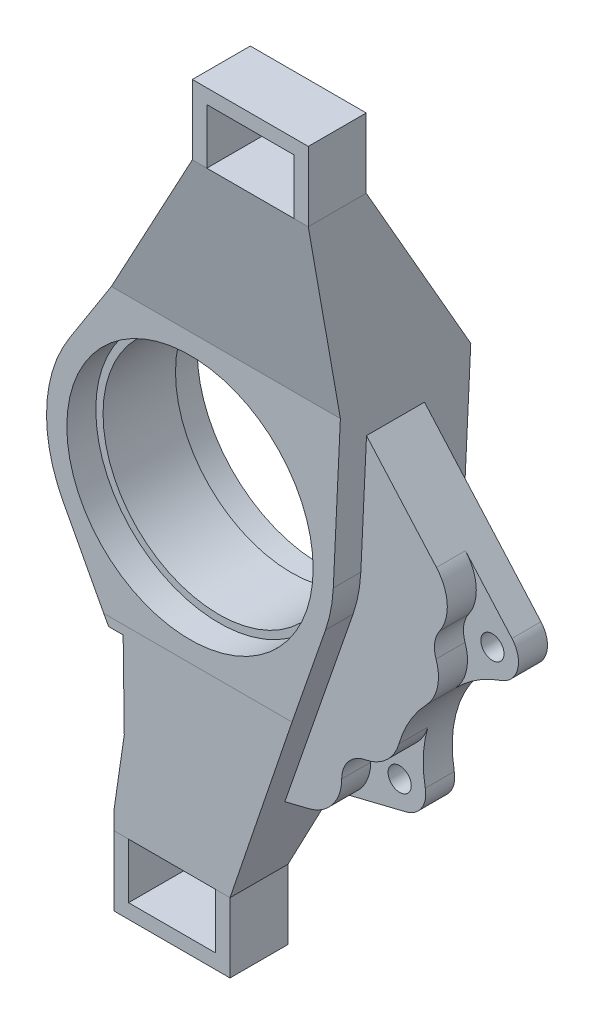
ISO-10303-21;
HEADER;
FILE_DESCRIPTION(('STEP AP214'),'2;1');
FILE_NAME('part.step','',(''),(''),'','','');
FILE_SCHEMA(('AUTOMOTIVE_DESIGN { 1 0 10303 214 1 1 1 1 }'));
ENDSEC;
DATA;
#1=APPLICATION_CONTEXT('core data for automotive mechanical design processes');
#2=APPLICATION_PROTOCOL_DEFINITION('international standard','automotive_design',2000,#1);
#3=PRODUCT_CONTEXT('',#1,'mechanical');
#4=PRODUCT('Part','Part','',(#3));
#5=PRODUCT_RELATED_PRODUCT_CATEGORY('part','',(#4));
#6=PRODUCT_DEFINITION_FORMATION('','',#4);
#7=PRODUCT_DEFINITION_CONTEXT('part definition',#1,'design');
#8=PRODUCT_DEFINITION('design','',#6,#7);
#9=PRODUCT_DEFINITION_SHAPE('','',#8);
#10=(LENGTH_UNIT() NAMED_UNIT(*) SI_UNIT(.MILLI.,.METRE.));
#11=(NAMED_UNIT(*) PLANE_ANGLE_UNIT() SI_UNIT($,.RADIAN.));
#12=(NAMED_UNIT(*) SI_UNIT($,.STERADIAN.) SOLID_ANGLE_UNIT());
#13=UNCERTAINTY_MEASURE_WITH_UNIT(LENGTH_MEASURE(1.E-05),#10,'distance_accuracy_value','');
#14=(GEOMETRIC_REPRESENTATION_CONTEXT(3) GLOBAL_UNCERTAINTY_ASSIGNED_CONTEXT((#13)) GLOBAL_UNIT_ASSIGNED_CONTEXT((#10,
#11,#12)) REPRESENTATION_CONTEXT('',''));
#15=CARTESIAN_POINT('',(0.,0.,0.));
#16=DIRECTION('',(0.,0.,1.));
#17=DIRECTION('',(1.,0.,0.));
#18=AXIS2_PLACEMENT_3D('',#15,#16,#17);
#19=CARTESIAN_POINT('',(-2.0122792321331E-13,1.11022302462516E-13,35.5));
#20=DIRECTION('',(0.,0.,-1.));
#21=DIRECTION('',(-1.,0.,0.));
#22=AXIS2_PLACEMENT_3D('',#19,#20,#21);
#23=PLANE('',#22);
#24=CARTESIAN_POINT('',(64.2899792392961,2.18694239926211,35.5));
#25=DIRECTION('',(0.,0.,1.));
#26=DIRECTION('',(1.,0.,0.));
#27=AXIS2_PLACEMENT_3D('',#24,#25,#26);
#28=CIRCLE('',#27,15.);
#29=CARTESIAN_POINT('',(76.6254034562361,-6.34753528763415,35.5));
#30=VERTEX_POINT('',#29);
#31=CARTESIAN_POINT('',(75.5355206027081,12.113563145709,35.5));
#32=VERTEX_POINT('',#31);
#33=EDGE_CURVE('E426',#30,#32,#28,.T.);
#34=ORIENTED_EDGE('',*,*,#33,.T.);
#35=DIRECTION('',(-0.661774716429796,0.749702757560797,0.));
#36=VECTOR('',#35,1.);
#37=CARTESIAN_POINT('',(91.59634441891,-6.08121463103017,35.5));
#38=LINE('',#37,#36);
#39=CARTESIAN_POINT('',(51.4142848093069,39.4397158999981,35.5));
#40=VERTEX_POINT('',#39);
#41=EDGE_CURVE('E490',#32,#40,#38,.T.);
#42=ORIENTED_EDGE('',*,*,#41,.T.);
#43=DIRECTION('',(-0.047090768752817,-0.998890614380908,0.));
#44=VECTOR('',#43,1.);
#45=CARTESIAN_POINT('',(51.4142848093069,39.4397158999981,35.5));
#46=LINE('',#45,#44);
#47=CARTESIAN_POINT('',(49.445085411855,-2.33099305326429,35.5));
#48=VERTEX_POINT('',#47);
#49=EDGE_CURVE('E492',#40,#48,#46,.T.);
#50=ORIENTED_EDGE('',*,*,#49,.T.);
#51=CARTESIAN_POINT('',(-2.0122792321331E-13,1.11022302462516E-13,35.5));
#52=DIRECTION('',(0.,0.,-1.));
#53=DIRECTION('',(-1.,0.,0.));
#54=AXIS2_PLACEMENT_3D('',#51,#52,#53);
#55=CIRCLE('',#54,49.5000000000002);
#56=CARTESIAN_POINT('',(46.7629364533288,-16.2319984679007,35.5));
#57=VERTEX_POINT('',#56);
#58=EDGE_CURVE('E496',#48,#57,#55,.T.);
#59=ORIENTED_EDGE('',*,*,#58,.T.);
#60=DIRECTION('',(-0.32791916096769,-0.944705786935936,0.));
#61=VECTOR('',#60,1.);
#62=CARTESIAN_POINT('',(46.7629364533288,-16.2319984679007,35.5));
#63=LINE('',#62,#61);
#64=CARTESIAN_POINT('',(23.2290055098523,-84.0311495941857,35.5));
#65=VERTEX_POINT('',#64);
#66=EDGE_CURVE('E499',#57,#65,#63,.T.);
#67=ORIENTED_EDGE('',*,*,#66,.T.);
#68=DIRECTION('',(0.970953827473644,0.239266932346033,0.));
#69=VECTOR('',#68,1.);
#70=CARTESIAN_POINT('',(23.2290055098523,-84.0311495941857,35.5));
#71=LINE('',#70,#69);
#72=CARTESIAN_POINT('',(31.4380307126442,-82.0082436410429,35.5));
#73=VERTEX_POINT('',#72);
#74=EDGE_CURVE('E501',#65,#73,#71,.T.);
#75=ORIENTED_EDGE('',*,*,#74,.T.);
#76=CARTESIAN_POINT('',(27.8490267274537,-67.4439362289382,35.5));
#77=DIRECTION('',(0.,0.,1.));
#78=DIRECTION('',(1.,0.,0.));
#79=AXIS2_PLACEMENT_3D('',#76,#77,#78);
#80=CIRCLE('',#79,15.);
#81=CARTESIAN_POINT('',(42.849022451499,-67.4552622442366,35.5));
#82=VERTEX_POINT('',#81);
#83=EDGE_CURVE('E476',#82,#73,#80,.F.);
#84=ORIENTED_EDGE('',*,*,#83,.F.);
#85=CARTESIAN_POINT('',(52.8490196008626,-67.4628129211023,35.5));
#86=DIRECTION('',(0.,0.,1.));
#87=DIRECTION('',(1.,0.,0.));
#88=AXIS2_PLACEMENT_3D('',#85,#86,#87);
#89=CIRCLE('',#88,10.);
#90=CARTESIAN_POINT('',(50.9838789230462,-57.6382900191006,35.5));
#91=VERTEX_POINT('',#90);
#92=EDGE_CURVE('E448',#91,#82,#89,.T.);
#93=ORIENTED_EDGE('',*,*,#92,.F.);
#94=CARTESIAN_POINT('',(48.1861679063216,-42.9015056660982,35.5));
#95=DIRECTION('',(0.,0.,1.));
#96=DIRECTION('',(1.,0.,0.));
#97=AXIS2_PLACEMENT_3D('',#94,#95,#96);
#98=CIRCLE('',#97,15.);
#99=CARTESIAN_POINT('',(62.5859714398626,-47.1021792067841,35.5));
#100=VERTEX_POINT('',#99);
#101=EDGE_CURVE('E459',#91,#100,#98,.T.);
#102=ORIENTED_EDGE('',*,*,#101,.T.);
#103=CARTESIAN_POINT('',(100.985447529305,-58.3039753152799,35.5));
#104=DIRECTION('',(0.,0.,-1.));
#105=DIRECTION('',(-1.,0.,0.));
#106=AXIS2_PLACEMENT_3D('',#103,#104,#105);
#107=CIRCLE('',#106,39.9999999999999);
#108=CARTESIAN_POINT('',(72.0846694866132,-30.649951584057,35.5));
#109=VERTEX_POINT('',#108);
#110=EDGE_CURVE('E504',#100,#109,#107,.T.);
#111=ORIENTED_EDGE('',*,*,#110,.T.);
#112=CARTESIAN_POINT('',(61.2468777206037,-20.2796926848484,35.5));
#113=DIRECTION('',(0.,0.,1.));
#114=DIRECTION('',(1.,0.,0.));
#115=AXIS2_PLACEMENT_3D('',#112,#113,#114);
#116=CIRCLE('',#115,15.);
#117=CARTESIAN_POINT('',(75.4081628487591,-15.3341893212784,35.5));
#118=VERTEX_POINT('',#117);
#119=EDGE_CURVE('E442',#118,#109,#116,.F.);
#120=ORIENTED_EDGE('',*,*,#119,.F.);
#121=CARTESIAN_POINT('',(84.8490196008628,-12.0371870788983,35.5));
#122=DIRECTION('',(0.,0.,1.));
#123=DIRECTION('',(1.,0.,0.));
#124=AXIS2_PLACEMENT_3D('',#121,#122,#123);
#125=CIRCLE('',#124,10.);
#126=EDGE_CURVE('E414',#30,#118,#125,.T.);
#127=ORIENTED_EDGE('',*,*,#126,.F.);
#128=EDGE_LOOP('',(#34,#42,#50,#59,#67,#75,#84,#93,#102,#111,#120,#127));
#129=FACE_BOUND('',#128,.T.);
#130=ADVANCED_FACE('F42',(#129),#23,.F.);
#131=CARTESIAN_POINT('',(100.985447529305,-58.3039753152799,59.1875));
#132=DIRECTION('',(0.,0.,-1.));
#133=DIRECTION('',(-1.,0.,0.));
#134=AXIS2_PLACEMENT_3D('',#131,#132,#133);
#135=CYLINDRICAL_SURFACE('',#134,40.);
#136=CARTESIAN_POINT('',(100.985447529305,-58.3039753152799,25.5));
#137=DIRECTION('',(0.,0.,1.));
#138=DIRECTION('',(1.,0.,0.));
#139=AXIS2_PLACEMENT_3D('',#136,#137,#138);
#140=CIRCLE('',#139,39.9999999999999);
#141=CARTESIAN_POINT('',(72.0846694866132,-30.649951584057,25.5));
#142=VERTEX_POINT('',#141);
#143=CARTESIAN_POINT('',(87.8128533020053,-20.5351685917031,25.5));
#144=VERTEX_POINT('',#143);
#145=EDGE_CURVE('E432',#142,#144,#140,.F.);
#146=ORIENTED_EDGE('',*,*,#145,.F.);
#147=DIRECTION('',(0.,0.,1.));
#148=VECTOR('',#147,1.);
#149=CARTESIAN_POINT('',(72.0846694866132,-30.649951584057,25.5));
#150=LINE('',#149,#148);
#151=EDGE_CURVE('E451',#142,#109,#150,.T.);
#152=ORIENTED_EDGE('',*,*,#151,.T.);
#153=ORIENTED_EDGE('',*,*,#110,.F.);
#154=DIRECTION('',(0.,0.,1.));
#155=VECTOR('',#154,1.);
#156=CARTESIAN_POINT('',(62.5859714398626,-47.1021792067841,25.5));
#157=LINE('',#156,#155);
#158=CARTESIAN_POINT('',(62.5859714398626,-47.1021792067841,25.5));
#159=VERTEX_POINT('',#158);
#160=EDGE_CURVE('E483',#159,#100,#157,.T.);
#161=ORIENTED_EDGE('',*,*,#160,.F.);
#162=CARTESIAN_POINT('',(100.985447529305,-58.3039753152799,25.5));
#163=DIRECTION('',(0.,0.,1.));
#164=DIRECTION('',(1.,0.,0.));
#165=AXIS2_PLACEMENT_3D('',#162,#163,#164);
#166=CIRCLE('',#165,39.9999999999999);
#167=CARTESIAN_POINT('',(61.6904043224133,-65.7805774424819,25.5));
#168=VERTEX_POINT('',#167);
#169=EDGE_CURVE('E469',#168,#159,#166,.F.);
#170=ORIENTED_EDGE('',*,*,#169,.F.);
#171=DIRECTION('',(0.,0.,-1.));
#172=VECTOR('',#171,1.);
#173=CARTESIAN_POINT('',(61.6904043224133,-65.7805774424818,59.1875));
#174=LINE('',#173,#172);
#175=CARTESIAN_POINT('',(61.6904043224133,-65.7805774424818,15.5));
#176=VERTEX_POINT('',#175);
#177=EDGE_CURVE('E691',#168,#176,#174,.T.);
#178=ORIENTED_EDGE('',*,*,#177,.T.);
#179=CARTESIAN_POINT('',(100.985447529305,-58.3039753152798,15.5));
#180=DIRECTION('',(0.,0.,-1.));
#181=DIRECTION('',(-1.,0.,0.));
#182=AXIS2_PLACEMENT_3D('',#179,#180,#181);
#183=CIRCLE('',#182,39.9999999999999);
#184=CARTESIAN_POINT('',(87.8128533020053,-20.5351685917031,15.5));
#185=VERTEX_POINT('',#184);
#186=EDGE_CURVE('E530',#176,#185,#183,.T.);
#187=ORIENTED_EDGE('',*,*,#186,.T.);
#188=DIRECTION('',(0.,0.,-1.));
#189=VECTOR('',#188,1.);
#190=CARTESIAN_POINT('',(87.8128533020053,-20.5351685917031,59.1875));
#191=LINE('',#190,#189);
#192=EDGE_CURVE('E716',#144,#185,#191,.T.);
#193=ORIENTED_EDGE('',*,*,#192,.F.);
#194=EDGE_LOOP('',(#146,#152,#153,#161,#170,#178,#187,#193));
#195=FACE_BOUND('',#194,.T.);
#196=ADVANCED_FACE('F933',(#195),#135,.F.);
#197=CARTESIAN_POINT('',(84.8490196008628,-12.0371870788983,59.1875));
#198=DIRECTION('',(0.,0.,-1.));
#199=DIRECTION('',(-1.,0.,0.));
#200=AXIS2_PLACEMENT_3D('',#197,#198,#199);
#201=CYLINDRICAL_SURFACE('',#200,9.);
#202=CARTESIAN_POINT('',(84.8490196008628,-12.0371870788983,25.5));
#203=DIRECTION('',(0.,0.,1.));
#204=DIRECTION('',(1.,0.,0.));
#205=AXIS2_PLACEMENT_3D('',#202,#203,#204);
#206=CIRCLE('',#205,8.99999999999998);
#207=CARTESIAN_POINT('',(91.59634441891,-6.08121463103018,25.5));
#208=VERTEX_POINT('',#207);
#209=EDGE_CURVE('E66',#144,#208,#206,.T.);
#210=ORIENTED_EDGE('',*,*,#209,.F.);
#211=ORIENTED_EDGE('',*,*,#192,.T.);
#212=CARTESIAN_POINT('',(84.8490196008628,-12.0371870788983,15.5));
#213=DIRECTION('',(0.,0.,1.));
#214=DIRECTION('',(1.,0.,0.));
#215=AXIS2_PLACEMENT_3D('',#212,#213,#214);
#216=CIRCLE('',#215,8.99999999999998);
#217=CARTESIAN_POINT('',(91.59634441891,-6.08121463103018,15.5));
#218=VERTEX_POINT('',#217);
#219=EDGE_CURVE('E533',#185,#218,#216,.T.);
#220=ORIENTED_EDGE('',*,*,#219,.T.);
#221=DIRECTION('',(0.,0.,-1.));
#222=VECTOR('',#221,1.);
#223=CARTESIAN_POINT('',(91.59634441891,-6.08121463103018,59.1875));
#224=LINE('',#223,#222);
#225=EDGE_CURVE('E771',#208,#218,#224,.T.);
#226=ORIENTED_EDGE('',*,*,#225,.F.);
#227=EDGE_LOOP('',(#210,#211,#220,#226));
#228=FACE_BOUND('',#227,.T.);
#229=ADVANCED_FACE('F929',(#228),#201,.T.);
#230=CARTESIAN_POINT('',(48.4650130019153,42.780848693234,59.1875));
#231=DIRECTION('',(-0.749702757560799,-0.661774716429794,0.));
#232=DIRECTION('',(0.661774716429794,-0.749702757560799,0.));
#233=AXIS2_PLACEMENT_3D('',#230,#231,#232);
#234=PLANE('',#233);
#235=DIRECTION('',(0.,0.,1.));
#236=VECTOR('',#235,1.);
#237=CARTESIAN_POINT('',(75.5355206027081,12.113563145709,25.5));
#238=LINE('',#237,#236);
#239=CARTESIAN_POINT('',(75.5355206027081,12.113563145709,25.5));
#240=VERTEX_POINT('',#239);
#241=EDGE_CURVE('E449',#240,#32,#238,.T.);
#242=ORIENTED_EDGE('',*,*,#241,.F.);
#243=DIRECTION('',(-0.661774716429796,0.749702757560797,0.));
#244=VECTOR('',#243,1.);
#245=CARTESIAN_POINT('',(48.4650130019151,42.780848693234,25.5));
#246=LINE('',#245,#244);
#247=EDGE_CURVE('E435',#208,#240,#246,.T.);
#248=ORIENTED_EDGE('',*,*,#247,.F.);
#249=ORIENTED_EDGE('',*,*,#225,.T.);
#250=DIRECTION('',(-0.661774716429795,0.749702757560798,0.));
#251=VECTOR('',#250,1.);
#252=CARTESIAN_POINT('',(91.59634441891,-6.08121463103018,15.5));
#253=LINE('',#252,#251);
#254=CARTESIAN_POINT('',(51.4142848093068,39.4397158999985,15.5));
#255=VERTEX_POINT('',#254);
#256=EDGE_CURVE('E517',#218,#255,#253,.T.);
#257=ORIENTED_EDGE('',*,*,#256,.T.);
#258=DIRECTION('',(0.,0.,-1.));
#259=VECTOR('',#258,1.);
#260=CARTESIAN_POINT('',(51.4142848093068,39.4397158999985,59.1875));
#261=LINE('',#260,#259);
#262=EDGE_CURVE('E769',#40,#255,#261,.T.);
#263=ORIENTED_EDGE('',*,*,#262,.F.);
#264=ORIENTED_EDGE('',*,*,#41,.F.);
#265=EDGE_LOOP('',(#242,#248,#249,#257,#263,#264));
#266=FACE_BOUND('',#265,.T.);
#267=ADVANCED_FACE('F919',(#266),#234,.F.);
#268=CARTESIAN_POINT('',(84.8490196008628,-12.0371870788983,59.1875));
#269=DIRECTION('',(0.,0.,-1.));
#270=DIRECTION('',(-1.,0.,0.));
#271=AXIS2_PLACEMENT_3D('',#268,#269,#270);
#272=CYLINDRICAL_SURFACE('',#271,3.99999999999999);
#273=CARTESIAN_POINT('',(84.8490196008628,-12.0371870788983,15.5));
#274=DIRECTION('',(0.,0.,-1.));
#275=DIRECTION('',(-1.,0.,0.));
#276=AXIS2_PLACEMENT_3D('',#273,#274,#275);
#277=CIRCLE('',#276,3.99999999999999);
#278=CARTESIAN_POINT('',(80.8490196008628,-12.0371870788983,15.5));
#279=VERTEX_POINT('',#278);
#280=EDGE_CURVE('E547',#279,#279,#277,.T.);
#281=ORIENTED_EDGE('',*,*,#280,.T.);
#282=EDGE_LOOP('',(#281));
#283=FACE_BOUND('',#282,.T.);
#284=CARTESIAN_POINT('',(84.8490196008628,-12.0371870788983,25.5));
#285=DIRECTION('',(0.,0.,1.));
#286=DIRECTION('',(1.,0.,0.));
#287=AXIS2_PLACEMENT_3D('',#284,#285,#286);
#288=CIRCLE('',#287,3.99999999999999);
#289=CARTESIAN_POINT('',(88.8490196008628,-12.0371870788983,25.5));
#290=VERTEX_POINT('',#289);
#291=EDGE_CURVE('E422',#290,#290,#288,.F.);
#292=ORIENTED_EDGE('',*,*,#291,.F.);
#293=EDGE_LOOP('',(#292));
#294=FACE_BOUND('',#293,.T.);
#295=ADVANCED_FACE('F1081',(#283,#294),#272,.F.);
#296=CARTESIAN_POINT('',(20.8517062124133,-84.616974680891,59.1875));
#297=DIRECTION('',(-0.239266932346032,0.970953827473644,0.));
#298=DIRECTION('',(-0.970953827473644,-0.239266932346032,0.));
#299=AXIS2_PLACEMENT_3D('',#296,#297,#298);
#300=PLANE('',#299);
#301=DIRECTION('',(0.,0.,1.));
#302=VECTOR('',#301,1.);
#303=CARTESIAN_POINT('',(31.4380307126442,-82.0082436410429,25.5));
#304=LINE('',#303,#302);
#305=CARTESIAN_POINT('',(31.4380307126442,-82.0082436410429,25.5));
#306=VERTEX_POINT('',#305);
#307=EDGE_CURVE('E485',#306,#73,#304,.T.);
#308=ORIENTED_EDGE('',*,*,#307,.T.);
#309=ORIENTED_EDGE('',*,*,#74,.F.);
#310=DIRECTION('',(0.,0.,-1.));
#311=VECTOR('',#310,1.);
#312=CARTESIAN_POINT('',(23.2290055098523,-84.0311495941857,59.1875));
#313=LINE('',#312,#311);
#314=CARTESIAN_POINT('',(23.2290055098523,-84.0311495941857,15.5));
#315=VERTEX_POINT('',#314);
#316=EDGE_CURVE('E727',#65,#315,#313,.T.);
#317=ORIENTED_EDGE('',*,*,#316,.T.);
#318=DIRECTION('',(0.970953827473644,0.239266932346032,0.));
#319=VECTOR('',#318,1.);
#320=CARTESIAN_POINT('',(23.2290055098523,-84.0311495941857,15.5));
#321=LINE('',#320,#319);
#322=CARTESIAN_POINT('',(55.0024219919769,-76.2013973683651,15.5));
#323=VERTEX_POINT('',#322);
#324=EDGE_CURVE('E524',#315,#323,#321,.T.);
#325=ORIENTED_EDGE('',*,*,#324,.T.);
#326=DIRECTION('',(0.,0.,-1.));
#327=VECTOR('',#326,1.);
#328=CARTESIAN_POINT('',(55.0024219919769,-76.2013973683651,59.1875));
#329=LINE('',#328,#327);
#330=CARTESIAN_POINT('',(55.0024219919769,-76.2013973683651,25.5));
#331=VERTEX_POINT('',#330);
#332=EDGE_CURVE('E725',#331,#323,#329,.T.);
#333=ORIENTED_EDGE('',*,*,#332,.F.);
#334=DIRECTION('',(0.970953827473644,0.239266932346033,0.));
#335=VECTOR('',#334,1.);
#336=CARTESIAN_POINT('',(20.8517062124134,-84.616974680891,25.5));
#337=LINE('',#336,#335);
#338=EDGE_CURVE('E465',#306,#331,#337,.T.);
#339=ORIENTED_EDGE('',*,*,#338,.F.);
#340=EDGE_LOOP('',(#308,#309,#317,#325,#333,#339));
#341=FACE_BOUND('',#340,.T.);
#342=ADVANCED_FACE('F944',(#341),#300,.F.);
#343=CARTESIAN_POINT('',(52.8490196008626,-67.4628129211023,59.1875));
#344=DIRECTION('',(0.,0.,-1.));
#345=DIRECTION('',(-1.,0.,0.));
#346=AXIS2_PLACEMENT_3D('',#343,#344,#345);
#347=CYLINDRICAL_SURFACE('',#346,4.00000000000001);
#348=CARTESIAN_POINT('',(52.8490196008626,-67.4628129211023,15.5));
#349=DIRECTION('',(0.,0.,-1.));
#350=DIRECTION('',(-1.,0.,0.));
#351=AXIS2_PLACEMENT_3D('',#348,#349,#350);
#352=CIRCLE('',#351,4.00000000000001);
#353=CARTESIAN_POINT('',(48.8490196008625,-67.4628129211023,15.5));
#354=VERTEX_POINT('',#353);
#355=EDGE_CURVE('E544',#354,#354,#352,.T.);
#356=ORIENTED_EDGE('',*,*,#355,.T.);
#357=EDGE_LOOP('',(#356));
#358=FACE_BOUND('',#357,.T.);
#359=CARTESIAN_POINT('',(52.8490196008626,-67.4628129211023,25.5));
#360=DIRECTION('',(0.,0.,1.));
#361=DIRECTION('',(1.,0.,0.));
#362=AXIS2_PLACEMENT_3D('',#359,#360,#361);
#363=CIRCLE('',#362,4.00000000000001);
#364=CARTESIAN_POINT('',(56.8490196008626,-67.4628129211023,25.5));
#365=VERTEX_POINT('',#364);
#366=EDGE_CURVE('E455',#365,#365,#363,.F.);
#367=ORIENTED_EDGE('',*,*,#366,.F.);
#368=EDGE_LOOP('',(#367));
#369=FACE_BOUND('',#368,.T.);
#370=ADVANCED_FACE('F1078',(#358,#369),#347,.F.);
#371=CARTESIAN_POINT('',(52.8490196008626,-67.4628129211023,59.1875));
#372=DIRECTION('',(0.,0.,-1.));
#373=DIRECTION('',(-1.,0.,0.));
#374=AXIS2_PLACEMENT_3D('',#371,#372,#373);
#375=CYLINDRICAL_SURFACE('',#374,9.00000000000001);
#376=CARTESIAN_POINT('',(52.8490196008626,-67.4628129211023,25.5));
#377=DIRECTION('',(0.,0.,1.));
#378=DIRECTION('',(1.,0.,0.));
#379=AXIS2_PLACEMENT_3D('',#376,#377,#378);
#380=CIRCLE('',#379,8.99999999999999);
#381=EDGE_CURVE('E467',#331,#168,#380,.T.);
#382=ORIENTED_EDGE('',*,*,#381,.F.);
#383=ORIENTED_EDGE('',*,*,#332,.T.);
#384=CARTESIAN_POINT('',(52.8490196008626,-67.4628129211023,15.5));
#385=DIRECTION('',(0.,0.,1.));
#386=DIRECTION('',(1.,0.,0.));
#387=AXIS2_PLACEMENT_3D('',#384,#385,#386);
#388=CIRCLE('',#387,8.99999999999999);
#389=EDGE_CURVE('E527',#323,#176,#388,.T.);
#390=ORIENTED_EDGE('',*,*,#389,.T.);
#391=ORIENTED_EDGE('',*,*,#177,.F.);
#392=EDGE_LOOP('',(#382,#383,#390,#391));
#393=FACE_BOUND('',#392,.T.);
#394=ADVANCED_FACE('F940',(#393),#375,.T.);
#395=CARTESIAN_POINT('',(0.,0.,0.));
#396=DIRECTION('',(0.,0.,1.));
#397=DIRECTION('',(1.,0.,0.));
#398=AXIS2_PLACEMENT_3D('',#395,#396,#397);
#399=PLANE('',#398);
#400=CARTESIAN_POINT('',(0.,0.,0.));
#401=DIRECTION('',(0.,0.,-1.));
#402=DIRECTION('',(-1.,0.,0.));
#403=AXIS2_PLACEMENT_3D('',#400,#401,#402);
#404=CIRCLE('',#403,42.5);
#405=CARTESIAN_POINT('',(-42.5,0.,0.));
#406=VERTEX_POINT('',#405);
#407=EDGE_CURVE('E711',#406,#406,#404,.T.);
#408=ORIENTED_EDGE('',*,*,#407,.F.);
#409=EDGE_LOOP('',(#408));
#410=FACE_BOUND('',#409,.T.);
#411=DIRECTION('',(-0.0470907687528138,-0.998890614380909,0.));
#412=VECTOR('',#411,1.);
#413=CARTESIAN_POINT('',(49.445085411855,-2.33099305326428,0.));
#414=LINE('',#413,#412);
#415=CARTESIAN_POINT('',(51.8885574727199,49.5,0.));
#416=VERTEX_POINT('',#415);
#417=CARTESIAN_POINT('',(49.445085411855,-2.33099305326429,0.));
#418=VERTEX_POINT('',#417);
#419=EDGE_CURVE('E668',#416,#418,#414,.T.);
#420=ORIENTED_EDGE('',*,*,#419,.T.);
#421=CARTESIAN_POINT('',(-2.15105711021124E-13,0.,0.));
#422=DIRECTION('',(0.,0.,-1.));
#423=DIRECTION('',(-1.,0.,0.));
#424=AXIS2_PLACEMENT_3D('',#421,#422,#423);
#425=CIRCLE('',#424,49.5000000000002);
#426=CARTESIAN_POINT('',(46.7629364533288,-16.2319984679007,0.));
#427=VERTEX_POINT('',#426);
#428=EDGE_CURVE('E514',#418,#427,#425,.T.);
#429=ORIENTED_EDGE('',*,*,#428,.T.);
#430=DIRECTION('',(-0.32791916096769,-0.944705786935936,0.));
#431=VECTOR('',#430,1.);
#432=CARTESIAN_POINT('',(46.7629364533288,-16.2319984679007,0.));
#433=LINE('',#432,#431);
#434=CARTESIAN_POINT('',(35.2151982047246,-49.5,0.));
#435=VERTEX_POINT('',#434);
#436=EDGE_CURVE('E520',#427,#435,#433,.T.);
#437=ORIENTED_EDGE('',*,*,#436,.T.);
#438=DIRECTION('',(1.,0.,0.));
#439=VECTOR('',#438,1.);
#440=CARTESIAN_POINT('',(-49.4599927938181,-49.5,0.));
#441=LINE('',#440,#439);
#442=CARTESIAN_POINT('',(-29.7761662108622,-49.5,0.));
#443=VERTEX_POINT('',#442);
#444=EDGE_CURVE('E550',#443,#435,#441,.T.);
#445=ORIENTED_EDGE('',*,*,#444,.F.);
#446=DIRECTION('',(0.468591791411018,-0.883414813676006,0.));
#447=VECTOR('',#446,1.);
#448=CARTESIAN_POINT('',(-43.7290332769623,-23.1952936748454,0.));
#449=LINE('',#448,#447);
#450=CARTESIAN_POINT('',(-43.7290332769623,-23.1952936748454,0.));
#451=VERTEX_POINT('',#450);
#452=EDGE_CURVE('E673',#451,#443,#449,.T.);
#453=ORIENTED_EDGE('',*,*,#452,.F.);
#454=CARTESIAN_POINT('',(0.,0.,0.));
#455=DIRECTION('',(0.,0.,1.));
#456=DIRECTION('',(1.,0.,0.));
#457=AXIS2_PLACEMENT_3D('',#454,#455,#456);
#458=CIRCLE('',#457,49.5);
#459=CARTESIAN_POINT('',(-41.7244628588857,26.6330471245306,0.));
#460=VERTEX_POINT('',#459);
#461=EDGE_CURVE('E790',#460,#451,#458,.T.);
#462=ORIENTED_EDGE('',*,*,#461,.F.);
#463=DIRECTION('',(0.538041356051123,0.84291844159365,0.));
#464=VECTOR('',#463,1.);
#465=CARTESIAN_POINT('',(-41.7244628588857,26.6330471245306,0.));
#466=LINE('',#465,#464);
#467=CARTESIAN_POINT('',(-27.1283101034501,49.5,0.));
#468=VERTEX_POINT('',#467);
#469=EDGE_CURVE('E693',#460,#468,#466,.T.);
#470=ORIENTED_EDGE('',*,*,#469,.T.);
#471=DIRECTION('',(1.,0.,0.));
#472=VECTOR('',#471,1.);
#473=CARTESIAN_POINT('',(-49.4599927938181,49.5,0.));
#474=LINE('',#473,#472);
#475=EDGE_CURVE('E590',#468,#416,#474,.T.);
#476=ORIENTED_EDGE('',*,*,#475,.T.);
#477=EDGE_LOOP('',(#420,#429,#437,#445,#453,#462,#470,#476));
#478=FACE_BOUND('',#477,.T.);
#479=ADVANCED_FACE('F843',(#410,#478),#399,.F.);
#480=CARTESIAN_POINT('',(-49.4599927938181,-6.18650346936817,-16.369456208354));
#481=DIRECTION('',(0.,0.353524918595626,0.935425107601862));
#482=DIRECTION('',(0.,-0.935425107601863,0.353524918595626));
#483=AXIS2_PLACEMENT_3D('',#480,#481,#482);
#484=PLANE('',#483);
#485=ORIENTED_EDGE('',*,*,#444,.T.);
#486=DIRECTION('',(0.308826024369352,0.889700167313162,-0.336244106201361));
#487=VECTOR('',#486,1.);
#488=CARTESIAN_POINT('',(39.3112629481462,-37.6996036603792,-4.45972010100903));
#489=LINE('',#488,#487);
#490=CARTESIAN_POINT('',(13.,-113.5,24.1875));
#491=VERTEX_POINT('',#490);
#492=EDGE_CURVE('E554',#491,#435,#489,.T.);
#493=ORIENTED_EDGE('',*,*,#492,.F.);
#494=DIRECTION('',(1.,0.,0.));
#495=VECTOR('',#494,1.);
#496=CARTESIAN_POINT('',(-49.4599927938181,-113.5,24.1875));
#497=LINE('',#496,#495);
#498=CARTESIAN_POINT('',(8.,-113.5,24.1875));
#499=VERTEX_POINT('',#498);
#500=EDGE_CURVE('E556',#499,#491,#497,.T.);
#501=ORIENTED_EDGE('',*,*,#500,.F.);
#502=CARTESIAN_POINT('',(-22.,-113.5,24.1875));
#503=VERTEX_POINT('',#502);
#504=EDGE_CURVE('E559',#503,#499,#497,.T.);
#505=ORIENTED_EDGE('',*,*,#504,.F.);
#506=CARTESIAN_POINT('',(-27.,-113.5,24.1875));
#507=VERTEX_POINT('',#506);
#508=EDGE_CURVE('E555',#507,#503,#497,.T.);
#509=ORIENTED_EDGE('',*,*,#508,.F.);
#510=DIRECTION('',(0.,-0.935425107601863,0.353524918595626));
#511=VECTOR('',#510,1.);
#512=CARTESIAN_POINT('',(-27.,-25.7595780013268,-8.97221026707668));
#513=LINE('',#512,#511);
#514=CARTESIAN_POINT('',(-27.,-107.5,21.919921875));
#515=VERTEX_POINT('',#514);
#516=EDGE_CURVE('E563',#515,#507,#513,.T.);
#517=ORIENTED_EDGE('',*,*,#516,.F.);
#518=DIRECTION('',(-0.145307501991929,-0.925497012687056,0.349772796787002));
#519=VECTOR('',#518,1.);
#520=CARTESIAN_POINT('',(-13.867246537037,-23.8544625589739,-9.69220995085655));
#521=LINE('',#520,#519);
#522=CARTESIAN_POINT('',(-23.1,-82.66,12.5321484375));
#523=VERTEX_POINT('',#522);
#524=EDGE_CURVE('E566',#523,#515,#521,.T.);
#525=ORIENTED_EDGE('',*,*,#524,.F.);
#526=DIRECTION('',(0.,-0.935425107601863,0.353524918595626));
#527=VECTOR('',#526,1.);
#528=CARTESIAN_POINT('',(-23.1,-25.7595780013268,-8.97221026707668));
#529=LINE('',#528,#527);
#530=CARTESIAN_POINT('',(-23.1,-52.66,1.1942578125));
#531=VERTEX_POINT('',#530);
#532=EDGE_CURVE('E569',#531,#523,#529,.T.);
#533=ORIENTED_EDGE('',*,*,#532,.F.);
#534=DIRECTION('',(1.,0.,0.));
#535=VECTOR('',#534,1.);
#536=CARTESIAN_POINT('',(0.,-52.66,1.1942578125));
#537=LINE('',#536,#535);
#538=CARTESIAN_POINT('',(-28.1,-52.66,1.1942578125));
#539=VERTEX_POINT('',#538);
#540=EDGE_CURVE('E572',#539,#531,#537,.T.);
#541=ORIENTED_EDGE('',*,*,#540,.F.);
#542=DIRECTION('',(0.444473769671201,-0.837946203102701,0.316684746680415));
#543=VECTOR('',#542,1.);
#544=CARTESIAN_POINT('',(-33.9985931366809,-41.5396503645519,-3.00845245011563));
#545=LINE('',#544,#543);
#546=EDGE_CURVE('E575',#443,#539,#545,.T.);
#547=ORIENTED_EDGE('',*,*,#546,.F.);
#548=EDGE_LOOP('',(#485,#493,#501,#505,#509,#517,#525,#533,#541,#547));
#549=FACE_BOUND('',#548,.T.);
#550=ADVANCED_FACE('F898',(#549),#484,.F.);
#551=CARTESIAN_POINT('',(49.445085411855,-2.33099305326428,59.1875));
#552=DIRECTION('',(0.998890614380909,-0.0470907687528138,0.));
#553=DIRECTION('',(0.0470907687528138,0.998890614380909,0.));
#554=AXIS2_PLACEMENT_3D('',#551,#552,#553);
#555=PLANE('',#554);
#556=DIRECTION('',(-0.0405029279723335,-0.859149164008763,-0.510119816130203));
#557=VECTOR('',#556,1.);
#558=CARTESIAN_POINT('',(51.3038245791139,37.0966306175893,-7.36450057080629));
#559=LINE('',#558,#557);
#560=CARTESIAN_POINT('',(55.,115.5,39.1875));
#561=VERTEX_POINT('',#560);
#562=EDGE_CURVE('E612',#561,#416,#559,.T.);
#563=ORIENTED_EDGE('',*,*,#562,.F.);
#564=DIRECTION('',(0.,0.,-1.));
#565=VECTOR('',#564,1.);
#566=CARTESIAN_POINT('',(55.,115.5,59.1875));
#567=LINE('',#566,#565);
#568=CARTESIAN_POINT('',(55.,115.5,59.1875));
#569=VERTEX_POINT('',#568);
#570=EDGE_CURVE('E766',#569,#561,#567,.T.);
#571=ORIENTED_EDGE('',*,*,#570,.F.);
#572=DIRECTION('',(-0.0460413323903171,-0.976629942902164,-0.209938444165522));
#573=VECTOR('',#572,1.);
#574=CARTESIAN_POINT('',(49.6899135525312,2.86230784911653,34.9746627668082));
#575=LINE('',#574,#573);
#576=CARTESIAN_POINT('',(51.8885574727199,49.5,45.));
#577=VERTEX_POINT('',#576);
#578=EDGE_CURVE('E629',#569,#577,#575,.T.);
#579=ORIENTED_EDGE('',*,*,#578,.T.);
#580=DIRECTION('',(-0.0470907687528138,-0.998890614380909,0.));
#581=VECTOR('',#580,1.);
#582=CARTESIAN_POINT('',(49.445085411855,-2.33099305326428,45.));
#583=LINE('',#582,#581);
#584=CARTESIAN_POINT('',(49.445085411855,-2.33099305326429,45.));
#585=VERTEX_POINT('',#584);
#586=EDGE_CURVE('E637',#577,#585,#583,.T.);
#587=ORIENTED_EDGE('',*,*,#586,.T.);
#588=DIRECTION('',(0.,0.,1.));
#589=VECTOR('',#588,1.);
#590=CARTESIAN_POINT('',(49.445085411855,-2.33099305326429,35.5));
#591=LINE('',#590,#589);
#592=EDGE_CURVE('E507',#48,#585,#591,.T.);
#593=ORIENTED_EDGE('',*,*,#592,.F.);
#594=ORIENTED_EDGE('',*,*,#49,.F.);
#595=ORIENTED_EDGE('',*,*,#262,.T.);
#596=DIRECTION('',(-0.0470907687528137,-0.998890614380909,0.));
#597=VECTOR('',#596,1.);
#598=CARTESIAN_POINT('',(51.4142848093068,39.4397158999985,15.5));
#599=LINE('',#598,#597);
#600=CARTESIAN_POINT('',(50.9409051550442,29.3983743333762,15.5));
#601=VERTEX_POINT('',#600);
#602=EDGE_CURVE('E368',#255,#601,#599,.T.);
#603=ORIENTED_EDGE('',*,*,#602,.T.);
#604=DIRECTION('',(0.,0.,-1.));
#605=VECTOR('',#604,1.);
#606=CARTESIAN_POINT('',(50.9409051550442,29.3983743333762,32.5));
#607=LINE('',#606,#605);
#608=CARTESIAN_POINT('',(50.9409051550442,29.3983743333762,32.5));
#609=VERTEX_POINT('',#608);
#610=EDGE_CURVE('E58',#609,#601,#607,.T.);
#611=ORIENTED_EDGE('',*,*,#610,.F.);
#612=DIRECTION('',(0.0470907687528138,0.998890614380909,0.));
#613=VECTOR('',#612,1.);
#614=CARTESIAN_POINT('',(49.445085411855,-2.33099305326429,32.5));
#615=LINE('',#614,#613);
#616=CARTESIAN_POINT('',(49.445085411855,-2.33099305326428,32.5));
#617=VERTEX_POINT('',#616);
#618=EDGE_CURVE('E365',#617,#609,#615,.T.);
#619=ORIENTED_EDGE('',*,*,#618,.F.);
#620=DIRECTION('',(0.,0.,-1.));
#621=VECTOR('',#620,1.);
#622=CARTESIAN_POINT('',(49.445085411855,-2.33099305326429,15.5));
#623=LINE('',#622,#621);
#624=EDGE_CURVE('E542',#617,#418,#623,.T.);
#625=ORIENTED_EDGE('',*,*,#624,.T.);
#626=ORIENTED_EDGE('',*,*,#419,.F.);
#627=EDGE_LOOP('',(#563,#571,#579,#587,#593,#594,#595,#603,#611,#619,#625,#626));
#628=FACE_BOUND('',#627,.T.);
#629=ADVANCED_FACE('F362',(#628),#555,.T.);
#630=CARTESIAN_POINT('',(-41.7244628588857,26.6330471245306,59.1875));
#631=DIRECTION('',(-0.84291844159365,0.538041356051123,0.));
#632=DIRECTION('',(-0.538041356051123,-0.84291844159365,0.));
#633=AXIS2_PLACEMENT_3D('',#630,#631,#632);
#634=PLANE('',#633);
#635=DIRECTION('',(0.481145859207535,0.75378353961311,0.447558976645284));
#636=VECTOR('',#635,1.);
#637=CARTESIAN_POINT('',(-26.0552173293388,51.1811527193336,0.998184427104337));
#638=LINE('',#637,#636);
#639=CARTESIAN_POINT('',(15.,115.5,39.1875));
#640=VERTEX_POINT('',#639);
#641=EDGE_CURVE('E609',#468,#640,#638,.T.);
#642=ORIENTED_EDGE('',*,*,#641,.F.);
#643=ORIENTED_EDGE('',*,*,#469,.F.);
#644=DIRECTION('',(0.,0.,-1.));
#645=VECTOR('',#644,1.);
#646=CARTESIAN_POINT('',(-41.7244628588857,26.6330471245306,59.1875));
#647=LINE('',#646,#645);
#648=CARTESIAN_POINT('',(-41.7244628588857,26.6330471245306,45.));
#649=VERTEX_POINT('',#648);
#650=EDGE_CURVE('E754',#649,#460,#647,.T.);
#651=ORIENTED_EDGE('',*,*,#650,.F.);
#652=DIRECTION('',(0.538041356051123,0.84291844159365,0.));
#653=VECTOR('',#652,1.);
#654=CARTESIAN_POINT('',(-41.7244628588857,26.6330471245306,45.));
#655=LINE('',#654,#653);
#656=CARTESIAN_POINT('',(-27.1283101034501,49.5,45.));
#657=VERTEX_POINT('',#656);
#658=EDGE_CURVE('E634',#649,#657,#655,.T.);
#659=ORIENTED_EDGE('',*,*,#658,.T.);
#660=DIRECTION('',(0.529420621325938,0.829412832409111,0.178292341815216));
#661=VECTOR('',#660,1.);
#662=CARTESIAN_POINT('',(-39.9212966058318,29.4579639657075,40.6917214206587));
#663=LINE('',#662,#661);
#664=CARTESIAN_POINT('',(15.,115.5,59.1875));
#665=VERTEX_POINT('',#664);
#666=EDGE_CURVE('E617',#657,#665,#663,.T.);
#667=ORIENTED_EDGE('',*,*,#666,.T.);
#668=DIRECTION('',(0.,0.,-1.));
#669=VECTOR('',#668,1.);
#670=CARTESIAN_POINT('',(15.,115.5,59.1875));
#671=LINE('',#670,#669);
#672=EDGE_CURVE('E757',#665,#640,#671,.T.);
#673=ORIENTED_EDGE('',*,*,#672,.T.);
#674=EDGE_LOOP('',(#642,#643,#651,#659,#667,#673));
#675=FACE_BOUND('',#674,.T.);
#676=ADVANCED_FACE('F829',(#675),#634,.T.);
#677=CARTESIAN_POINT('',(-43.7290332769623,-23.1952936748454,59.1875));
#678=DIRECTION('',(0.883414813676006,0.468591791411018,0.));
#679=DIRECTION('',(-0.468591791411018,0.883414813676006,0.));
#680=AXIS2_PLACEMENT_3D('',#677,#678,#679);
#681=PLANE('',#680);
#682=ORIENTED_EDGE('',*,*,#452,.T.);
#683=ORIENTED_EDGE('',*,*,#546,.T.);
#684=DIRECTION('',(0.,0.,-1.));
#685=VECTOR('',#684,1.);
#686=CARTESIAN_POINT('',(-28.1,-52.66,59.1875));
#687=LINE('',#686,#685);
#688=CARTESIAN_POINT('',(-28.1,-52.66,44.9598828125));
#689=VERTEX_POINT('',#688);
#690=EDGE_CURVE('E748',#689,#539,#687,.T.);
#691=ORIENTED_EDGE('',*,*,#690,.F.);
#692=DIRECTION('',(-0.468562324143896,0.88335926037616,0.0112145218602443));
#693=VECTOR('',#692,1.);
#694=CARTESIAN_POINT('',(-43.8018295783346,-23.0580541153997,45.3356887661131));
#695=LINE('',#694,#693);
#696=CARTESIAN_POINT('',(-29.7761662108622,-49.5,45.));
#697=VERTEX_POINT('',#696);
#698=EDGE_CURVE('E654',#689,#697,#695,.T.);
#699=ORIENTED_EDGE('',*,*,#698,.T.);
#700=DIRECTION('',(0.468591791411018,-0.883414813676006,0.));
#701=VECTOR('',#700,1.);
#702=CARTESIAN_POINT('',(-43.7290332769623,-23.1952936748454,45.));
#703=LINE('',#702,#701);
#704=CARTESIAN_POINT('',(-43.7290332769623,-23.1952936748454,45.));
#705=VERTEX_POINT('',#704);
#706=EDGE_CURVE('E632',#705,#697,#703,.T.);
#707=ORIENTED_EDGE('',*,*,#706,.F.);
#708=DIRECTION('',(0.,0.,-1.));
#709=VECTOR('',#708,1.);
#710=CARTESIAN_POINT('',(-43.7290332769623,-23.1952936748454,59.1875));
#711=LINE('',#710,#709);
#712=EDGE_CURVE('E751',#705,#451,#711,.T.);
#713=ORIENTED_EDGE('',*,*,#712,.T.);
#714=EDGE_LOOP('',(#682,#683,#691,#699,#707,#713));
#715=FACE_BOUND('',#714,.T.);
#716=ADVANCED_FACE('F857',(#715),#681,.F.);
#717=CARTESIAN_POINT('',(0.,0.,59.1875));
#718=DIRECTION('',(0.,0.,1.));
#719=DIRECTION('',(1.,0.,0.));
#720=AXIS2_PLACEMENT_3D('',#717,#718,#719);
#721=PLANE('',#720);
#722=DIRECTION('',(0.,1.,0.));
#723=VECTOR('',#722,1.);
#724=CARTESIAN_POINT('',(15.,0.,59.1875));
#725=LINE('',#724,#723);
#726=CARTESIAN_POINT('',(15.,139.5,59.1875));
#727=VERTEX_POINT('',#726);
#728=EDGE_CURVE('E676',#665,#727,#725,.T.);
#729=ORIENTED_EDGE('',*,*,#728,.F.);
#730=DIRECTION('',(1.,0.,0.));
#731=VECTOR('',#730,1.);
#732=CARTESIAN_POINT('',(0.,115.5,59.1875));
#733=LINE('',#732,#731);
#734=CARTESIAN_POINT('',(20.,115.5,59.1875));
#735=VERTEX_POINT('',#734);
#736=EDGE_CURVE('E798',#665,#735,#733,.T.);
#737=ORIENTED_EDGE('',*,*,#736,.T.);
#738=DIRECTION('',(0.,-1.,0.));
#739=VECTOR('',#738,1.);
#740=CARTESIAN_POINT('',(20.,0.,59.1875));
#741=LINE('',#740,#739);
#742=CARTESIAN_POINT('',(20.,134.5,59.1875));
#743=VERTEX_POINT('',#742);
#744=EDGE_CURVE('E688',#743,#735,#741,.T.);
#745=ORIENTED_EDGE('',*,*,#744,.F.);
#746=DIRECTION('',(1.,0.,0.));
#747=VECTOR('',#746,1.);
#748=CARTESIAN_POINT('',(0.,134.5,59.1875));
#749=LINE('',#748,#747);
#750=CARTESIAN_POINT('',(50.,134.5,59.1875));
#751=VERTEX_POINT('',#750);
#752=EDGE_CURVE('E679',#743,#751,#749,.T.);
#753=ORIENTED_EDGE('',*,*,#752,.T.);
#754=DIRECTION('',(0.,-1.,0.));
#755=VECTOR('',#754,1.);
#756=CARTESIAN_POINT('',(50.,0.,59.1875));
#757=LINE('',#756,#755);
#758=CARTESIAN_POINT('',(50.,115.5,59.1875));
#759=VERTEX_POINT('',#758);
#760=EDGE_CURVE('E682',#751,#759,#757,.T.);
#761=ORIENTED_EDGE('',*,*,#760,.T.);
#762=EDGE_CURVE('E789',#759,#569,#733,.T.);
#763=ORIENTED_EDGE('',*,*,#762,.T.);
#764=DIRECTION('',(0.,-1.,0.));
#765=VECTOR('',#764,1.);
#766=CARTESIAN_POINT('',(55.,0.,59.1875));
#767=LINE('',#766,#765);
#768=CARTESIAN_POINT('',(55.,139.5,59.1875));
#769=VERTEX_POINT('',#768);
#770=EDGE_CURVE('E669',#769,#569,#767,.T.);
#771=ORIENTED_EDGE('',*,*,#770,.F.);
#772=DIRECTION('',(1.,0.,0.));
#773=VECTOR('',#772,1.);
#774=CARTESIAN_POINT('',(0.,139.5,59.1875));
#775=LINE('',#774,#773);
#776=EDGE_CURVE('E672',#727,#769,#775,.T.);
#777=ORIENTED_EDGE('',*,*,#776,.F.);
#778=EDGE_LOOP('',(#729,#737,#745,#753,#761,#763,#771,#777));
#779=FACE_BOUND('',#778,.T.);
#780=ADVANCED_FACE('F821',(#779),#721,.T.);
#781=CARTESIAN_POINT('',(0.,0.,45.));
#782=DIRECTION('',(0.,0.,-1.));
#783=DIRECTION('',(-1.,0.,0.));
#784=AXIS2_PLACEMENT_3D('',#781,#782,#783);
#785=CYLINDRICAL_SURFACE('',#784,40.);
#786=CARTESIAN_POINT('',(0.,0.,35.));
#787=DIRECTION('',(0.,0.,1.));
#788=DIRECTION('',(1.,0.,0.));
#789=AXIS2_PLACEMENT_3D('',#786,#787,#788);
#790=CIRCLE('',#789,40.);
#791=CARTESIAN_POINT('',(-40.,0.,35.));
#792=VERTEX_POINT('',#791);
#793=EDGE_CURVE('E783',#792,#792,#790,.T.);
#794=CARTESIAN_POINT('',(0.,0.,10.));
#795=DIRECTION('',(0.,0.,-1.));
#796=DIRECTION('',(-1.,0.,0.));
#797=AXIS2_PLACEMENT_3D('',#794,#795,#796);
#798=CIRCLE('',#797,40.);
#799=CARTESIAN_POINT('',(-40.,0.,10.));
#800=VERTEX_POINT('',#799);
#801=EDGE_CURVE('E777',#800,#800,#798,.T.);
#802=CARTESIAN_POINT('',(-40.,0.,35.));
#803=CARTESIAN_POINT('',(-40.,0.,34.7395833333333));
#804=CARTESIAN_POINT('',(-40.,0.,34.4791666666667));
#805=CARTESIAN_POINT('',(-40.,0.,33.9583333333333));
#806=CARTESIAN_POINT('',(-40.,0.,33.6979166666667));
#807=CARTESIAN_POINT('',(-40.,0.,33.1770833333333));
#808=CARTESIAN_POINT('',(-40.,0.,32.9166666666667));
#809=CARTESIAN_POINT('',(-40.,0.,32.3958333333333));
#810=CARTESIAN_POINT('',(-40.,0.,32.1354166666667));
#811=CARTESIAN_POINT('',(-40.,0.,31.6145833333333));
#812=CARTESIAN_POINT('',(-40.,0.,31.3541666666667));
#813=CARTESIAN_POINT('',(-40.,0.,30.8333333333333));
#814=CARTESIAN_POINT('',(-40.,0.,30.5729166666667));
#815=CARTESIAN_POINT('',(-40.,0.,30.0520833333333));
#816=CARTESIAN_POINT('',(-40.,0.,29.7916666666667));
#817=CARTESIAN_POINT('',(-40.,0.,29.2708333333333));
#818=CARTESIAN_POINT('',(-40.,0.,29.0104166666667));
#819=CARTESIAN_POINT('',(-40.,0.,28.4895833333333));
#820=CARTESIAN_POINT('',(-40.,0.,28.2291666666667));
#821=CARTESIAN_POINT('',(-40.,0.,27.7083333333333));
#822=CARTESIAN_POINT('',(-40.,0.,27.4479166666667));
#823=CARTESIAN_POINT('',(-40.,0.,26.9270833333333));
#824=CARTESIAN_POINT('',(-40.,0.,26.6666666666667));
#825=CARTESIAN_POINT('',(-40.,0.,26.1458333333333));
#826=CARTESIAN_POINT('',(-40.,0.,25.8854166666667));
#827=CARTESIAN_POINT('',(-40.,0.,25.3645833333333));
#828=CARTESIAN_POINT('',(-40.,0.,25.1041666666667));
#829=CARTESIAN_POINT('',(-40.,0.,24.5833333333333));
#830=CARTESIAN_POINT('',(-40.,0.,24.3229166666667));
#831=CARTESIAN_POINT('',(-40.,0.,23.8020833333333));
#832=CARTESIAN_POINT('',(-40.,0.,23.5416666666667));
#833=CARTESIAN_POINT('',(-40.,0.,23.0208333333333));
#834=CARTESIAN_POINT('',(-40.,0.,22.7604166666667));
#835=CARTESIAN_POINT('',(-40.,0.,22.2395833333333));
#836=CARTESIAN_POINT('',(-40.,0.,21.9791666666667));
#837=CARTESIAN_POINT('',(-40.,0.,21.4583333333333));
#838=CARTESIAN_POINT('',(-40.,0.,21.1979166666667));
#839=CARTESIAN_POINT('',(-40.,0.,20.6770833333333));
#840=CARTESIAN_POINT('',(-40.,0.,20.4166666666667));
#841=CARTESIAN_POINT('',(-40.,0.,19.8958333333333));
#842=CARTESIAN_POINT('',(-40.,0.,19.6354166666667));
#843=CARTESIAN_POINT('',(-40.,0.,19.1145833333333));
#844=CARTESIAN_POINT('',(-40.,0.,18.8541666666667));
#845=CARTESIAN_POINT('',(-40.,0.,18.3333333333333));
#846=CARTESIAN_POINT('',(-40.,0.,18.0729166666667));
#847=CARTESIAN_POINT('',(-40.,0.,17.5520833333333));
#848=CARTESIAN_POINT('',(-40.,0.,17.2916666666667));
#849=CARTESIAN_POINT('',(-40.,0.,16.7708333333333));
#850=CARTESIAN_POINT('',(-40.,0.,16.5104166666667));
#851=CARTESIAN_POINT('',(-40.,0.,15.9895833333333));
#852=CARTESIAN_POINT('',(-40.,0.,15.7291666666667));
#853=CARTESIAN_POINT('',(-40.,0.,15.2083333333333));
#854=CARTESIAN_POINT('',(-40.,0.,14.9479166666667));
#855=CARTESIAN_POINT('',(-40.,0.,14.4270833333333));
#856=CARTESIAN_POINT('',(-40.,0.,14.1666666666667));
#857=CARTESIAN_POINT('',(-40.,0.,13.6458333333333));
#858=CARTESIAN_POINT('',(-40.,0.,13.3854166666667));
#859=CARTESIAN_POINT('',(-40.,0.,12.8645833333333));
#860=CARTESIAN_POINT('',(-40.,0.,12.6041666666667));
#861=CARTESIAN_POINT('',(-40.,0.,12.0833333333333));
#862=CARTESIAN_POINT('',(-40.,0.,11.8229166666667));
#863=CARTESIAN_POINT('',(-40.,0.,11.3020833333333));
#864=CARTESIAN_POINT('',(-40.,0.,11.0416666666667));
#865=CARTESIAN_POINT('',(-40.,0.,10.5208333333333));
#866=CARTESIAN_POINT('',(-40.,0.,10.2604166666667));
#867=CARTESIAN_POINT('',(-40.,0.,10.));
#868=B_SPLINE_CURVE_WITH_KNOTS('',3,(#802,#803,#804,#805,#806,#807,#808,#809,#810,#811,#812,
#813,#814,#815,#816,#817,#818,#819,#820,#821,#822,#823,#824,#825,#826,#827,#828,#829,#830,#831,
#832,#833,#834,#835,#836,#837,#838,#839,#840,#841,#842,#843,#844,#845,#846,#847,#848,#849,#850,
#851,#852,#853,#854,#855,#856,#857,#858,#859,#860,#861,#862,#863,#864,#865,#866,#867),
.UNSPECIFIED.,.F.,.F.,(4,2,2,2,2,2,2,2,2,2,2,2,2,2,2,2,2,2,2,2,2,2,2,2,2,2,2,2,2,2,2,2,4),(0.,
0.781250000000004,1.5625,2.34375,3.125,3.90625,4.6875,5.46875,6.25,7.03125,7.8125,8.59375,9.375,
10.15625,10.9375,11.71875,12.5,13.28125,14.0625,14.84375,15.625,16.40625,17.1875,17.96875,18.75,
19.53125,20.3125,21.09375,21.875,22.65625,23.4375,24.21875,25.),.UNSPECIFIED.);
#869=EDGE_CURVE('BSEAM45',#792,#800,#868,.T.);
#870=ORIENTED_EDGE('',*,*,#793,.T.);
#871=ORIENTED_EDGE('',*,*,#801,.T.);
#872=ORIENTED_EDGE('',*,*,#869,.T.);
#873=ORIENTED_EDGE('',*,*,#869,.F.);
#874=EDGE_LOOP('',(#870,#872,#871,#873));
#875=FACE_BOUND('',#874,.T.);
#876=ADVANCED_FACE('F45',(#875),#785,.F.);
#877=CARTESIAN_POINT('',(0.,0.,45.));
#878=DIRECTION('',(0.,0.,-1.));
#879=DIRECTION('',(-1.,0.,0.));
#880=AXIS2_PLACEMENT_3D('',#877,#878,#879);
#881=CYLINDRICAL_SURFACE('',#880,49.5);
#882=CARTESIAN_POINT('',(0.,0.,45.));
#883=DIRECTION('',(0.,0.,1.));
#884=DIRECTION('',(1.,0.,0.));
#885=AXIS2_PLACEMENT_3D('',#882,#883,#884);
#886=CIRCLE('',#885,49.5);
#887=EDGE_CURVE('E787',#649,#705,#886,.T.);
#888=ORIENTED_EDGE('',*,*,#887,.F.);
#889=ORIENTED_EDGE('',*,*,#650,.T.);
#890=ORIENTED_EDGE('',*,*,#461,.T.);
#891=ORIENTED_EDGE('',*,*,#712,.F.);
#892=EDGE_LOOP('',(#888,#889,#890,#891));
#893=FACE_BOUND('',#892,.T.);
#894=ADVANCED_FACE('F848',(#893),#881,.T.);
#895=CARTESIAN_POINT('',(0.,0.,45.));
#896=DIRECTION('',(0.,0.,1.));
#897=DIRECTION('',(1.,0.,0.));
#898=AXIS2_PLACEMENT_3D('',#895,#896,#897);
#899=PLANE('',#898);
#900=DIRECTION('',(-0.32791916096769,-0.944705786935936,0.));
#901=VECTOR('',#900,1.);
#902=CARTESIAN_POINT('',(46.7629364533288,-16.2319984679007,45.));
#903=LINE('',#902,#901);
#904=CARTESIAN_POINT('',(46.7629364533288,-16.2319984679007,45.));
#905=VERTEX_POINT('',#904);
#906=CARTESIAN_POINT('',(35.2151982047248,-49.5,45.));
#907=VERTEX_POINT('',#906);
#908=EDGE_CURVE('E493',#905,#907,#903,.T.);
#909=ORIENTED_EDGE('',*,*,#908,.F.);
#910=CARTESIAN_POINT('',(-2.0122792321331E-13,1.11022302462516E-13,45.));
#911=DIRECTION('',(0.,0.,-1.));
#912=DIRECTION('',(-1.,0.,0.));
#913=AXIS2_PLACEMENT_3D('',#910,#911,#912);
#914=CIRCLE('',#913,49.5000000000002);
#915=EDGE_CURVE('E482',#585,#905,#914,.T.);
#916=ORIENTED_EDGE('',*,*,#915,.F.);
#917=ORIENTED_EDGE('',*,*,#586,.F.);
#918=DIRECTION('',(1.,0.,0.));
#919=VECTOR('',#918,1.);
#920=CARTESIAN_POINT('',(-49.4599927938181,49.5,45.));
#921=LINE('',#920,#919);
#922=EDGE_CURVE('E615',#657,#577,#921,.T.);
#923=ORIENTED_EDGE('',*,*,#922,.F.);
#924=ORIENTED_EDGE('',*,*,#658,.F.);
#925=ORIENTED_EDGE('',*,*,#887,.T.);
#926=ORIENTED_EDGE('',*,*,#706,.T.);
#927=DIRECTION('',(1.,0.,0.));
#928=VECTOR('',#927,1.);
#929=CARTESIAN_POINT('',(-49.4599927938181,-49.5,45.));
#930=LINE('',#929,#928);
#931=EDGE_CURVE('E618',#697,#907,#930,.T.);
#932=ORIENTED_EDGE('',*,*,#931,.T.);
#933=EDGE_LOOP('',(#909,#916,#917,#923,#924,#925,#926,#932));
#934=FACE_BOUND('',#933,.T.);
#935=CARTESIAN_POINT('',(0.,0.,45.));
#936=DIRECTION('',(0.,0.,1.));
#937=DIRECTION('',(1.,0.,0.));
#938=AXIS2_PLACEMENT_3D('',#935,#936,#937);
#939=CIRCLE('',#938,42.5);
#940=CARTESIAN_POINT('',(42.5,0.,45.));
#941=VERTEX_POINT('',#940);
#942=EDGE_CURVE('E784',#941,#941,#939,.T.);
#943=ORIENTED_EDGE('',*,*,#942,.F.);
#944=EDGE_LOOP('',(#943));
#945=FACE_BOUND('',#944,.T.);
#946=ADVANCED_FACE('F853',(#934,#945),#899,.T.);
#947=CARTESIAN_POINT('',(0.,0.,35.));
#948=DIRECTION('',(0.,0.,1.));
#949=DIRECTION('',(1.,0.,0.));
#950=AXIS2_PLACEMENT_3D('',#947,#948,#949);
#951=CYLINDRICAL_SURFACE('',#950,42.5);
#952=CARTESIAN_POINT('',(0.,0.,35.));
#953=DIRECTION('',(0.,0.,1.));
#954=DIRECTION('',(1.,0.,0.));
#955=AXIS2_PLACEMENT_3D('',#952,#953,#954);
#956=CIRCLE('',#955,42.5);
#957=CARTESIAN_POINT('',(42.5,0.,35.));
#958=VERTEX_POINT('',#957);
#959=EDGE_CURVE('E780',#958,#958,#956,.T.);
#960=ORIENTED_EDGE('',*,*,#959,.F.);
#961=EDGE_LOOP('',(#960));
#962=FACE_BOUND('',#961,.T.);
#963=ORIENTED_EDGE('',*,*,#942,.T.);
#964=EDGE_LOOP('',(#963));
#965=FACE_BOUND('',#964,.T.);
#966=ADVANCED_FACE('F1063',(#962,#965),#951,.F.);
#967=CARTESIAN_POINT('',(0.,0.,35.));
#968=DIRECTION('',(0.,0.,1.));
#969=DIRECTION('',(1.,0.,0.));
#970=AXIS2_PLACEMENT_3D('',#967,#968,#969);
#971=PLANE('',#970);
#972=ORIENTED_EDGE('',*,*,#793,.F.);
#973=EDGE_LOOP('',(#972));
#974=FACE_BOUND('',#973,.T.);
#975=ORIENTED_EDGE('',*,*,#959,.T.);
#976=EDGE_LOOP('',(#975));
#977=FACE_BOUND('',#976,.T.);
#978=ADVANCED_FACE('F1060',(#974,#977),#971,.T.);
#979=CARTESIAN_POINT('',(0.,0.,10.));
#980=DIRECTION('',(0.,0.,-1.));
#981=DIRECTION('',(-1.,0.,0.));
#982=AXIS2_PLACEMENT_3D('',#979,#980,#981);
#983=CYLINDRICAL_SURFACE('',#982,42.5);
#984=CARTESIAN_POINT('',(0.,0.,10.));
#985=DIRECTION('',(0.,0.,-1.));
#986=DIRECTION('',(-1.,0.,0.));
#987=AXIS2_PLACEMENT_3D('',#984,#985,#986);
#988=CIRCLE('',#987,42.5);
#989=CARTESIAN_POINT('',(-42.5,0.,10.));
#990=VERTEX_POINT('',#989);
#991=EDGE_CURVE('E774',#990,#990,#988,.T.);
#992=ORIENTED_EDGE('',*,*,#991,.F.);
#993=EDGE_LOOP('',(#992));
#994=FACE_BOUND('',#993,.T.);
#995=ORIENTED_EDGE('',*,*,#407,.T.);
#996=EDGE_LOOP('',(#995));
#997=FACE_BOUND('',#996,.T.);
#998=ADVANCED_FACE('F1057',(#994,#997),#983,.F.);
#999=CARTESIAN_POINT('',(0.,0.,10.));
#1000=DIRECTION('',(0.,0.,-1.));
#1001=DIRECTION('',(-1.,0.,0.));
#1002=AXIS2_PLACEMENT_3D('',#999,#1000,#1001);
#1003=PLANE('',#1002);
#1004=ORIENTED_EDGE('',*,*,#801,.F.);
#1005=EDGE_LOOP('',(#1004));
#1006=FACE_BOUND('',#1005,.T.);
#1007=ORIENTED_EDGE('',*,*,#991,.T.);
#1008=EDGE_LOOP('',(#1007));
#1009=FACE_BOUND('',#1008,.T.);
#1010=ADVANCED_FACE('F1054',(#1006,#1009),#1003,.T.);
#1011=CARTESIAN_POINT('',(0.,134.5,59.1875));
#1012=DIRECTION('',(0.,1.,0.));
#1013=DIRECTION('',(0.,0.,1.));
#1014=AXIS2_PLACEMENT_3D('',#1011,#1012,#1013);
#1015=PLANE('',#1014);
#1016=DIRECTION('',(0.,0.,-1.));
#1017=VECTOR('',#1016,1.);
#1018=CARTESIAN_POINT('',(20.,134.5,59.1875));
#1019=LINE('',#1018,#1017);
#1020=CARTESIAN_POINT('',(20.,134.5,39.1875));
#1021=VERTEX_POINT('',#1020);
#1022=EDGE_CURVE('E698',#743,#1021,#1019,.T.);
#1023=ORIENTED_EDGE('',*,*,#1022,.T.);
#1024=DIRECTION('',(1.,0.,0.));
#1025=VECTOR('',#1024,1.);
#1026=CARTESIAN_POINT('',(0.,134.5,39.1875));
#1027=LINE('',#1026,#1025);
#1028=CARTESIAN_POINT('',(50.,134.5,39.1875));
#1029=VERTEX_POINT('',#1028);
#1030=EDGE_CURVE('E593',#1021,#1029,#1027,.T.);
#1031=ORIENTED_EDGE('',*,*,#1030,.T.);
#1032=DIRECTION('',(0.,0.,-1.));
#1033=VECTOR('',#1032,1.);
#1034=CARTESIAN_POINT('',(50.,134.5,59.1875));
#1035=LINE('',#1034,#1033);
#1036=EDGE_CURVE('E708',#751,#1029,#1035,.T.);
#1037=ORIENTED_EDGE('',*,*,#1036,.F.);
#1038=ORIENTED_EDGE('',*,*,#752,.F.);
#1039=EDGE_LOOP('',(#1023,#1031,#1037,#1038));
#1040=FACE_BOUND('',#1039,.T.);
#1041=ADVANCED_FACE('F1051',(#1040),#1015,.F.);
#1042=CARTESIAN_POINT('',(50.,0.,59.1875));
#1043=DIRECTION('',(1.,0.,0.));
#1044=DIRECTION('',(0.,0.,-1.));
#1045=AXIS2_PLACEMENT_3D('',#1042,#1043,#1044);
#1046=PLANE('',#1045);
#1047=ORIENTED_EDGE('',*,*,#1036,.T.);
#1048=DIRECTION('',(0.,-1.,0.));
#1049=VECTOR('',#1048,1.);
#1050=CARTESIAN_POINT('',(50.,0.,39.1875));
#1051=LINE('',#1050,#1049);
#1052=CARTESIAN_POINT('',(50.,115.5,39.1875));
#1053=VERTEX_POINT('',#1052);
#1054=EDGE_CURVE('E602',#1029,#1053,#1051,.T.);
#1055=ORIENTED_EDGE('',*,*,#1054,.T.);
#1056=DIRECTION('',(0.,0.,-1.));
#1057=VECTOR('',#1056,1.);
#1058=CARTESIAN_POINT('',(50.,115.5,59.1875));
#1059=LINE('',#1058,#1057);
#1060=EDGE_CURVE('E705',#759,#1053,#1059,.T.);
#1061=ORIENTED_EDGE('',*,*,#1060,.F.);
#1062=ORIENTED_EDGE('',*,*,#760,.F.);
#1063=EDGE_LOOP('',(#1047,#1055,#1061,#1062));
#1064=FACE_BOUND('',#1063,.T.);
#1065=ADVANCED_FACE('F1049',(#1064),#1046,.F.);
#1066=CARTESIAN_POINT('',(0.,115.5,59.1875));
#1067=DIRECTION('',(0.,1.,0.));
#1068=DIRECTION('',(0.,0.,1.));
#1069=AXIS2_PLACEMENT_3D('',#1066,#1067,#1068);
#1070=PLANE('',#1069);
#1071=DIRECTION('',(1.,0.,0.));
#1072=VECTOR('',#1071,1.);
#1073=CARTESIAN_POINT('',(-49.4599927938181,115.5,39.1875));
#1074=LINE('',#1073,#1072);
#1075=CARTESIAN_POINT('',(20.,115.5,39.1875));
#1076=VERTEX_POINT('',#1075);
#1077=EDGE_CURVE('E598',#1076,#1053,#1074,.T.);
#1078=ORIENTED_EDGE('',*,*,#1077,.F.);
#1079=DIRECTION('',(0.,0.,-1.));
#1080=VECTOR('',#1079,1.);
#1081=CARTESIAN_POINT('',(20.,115.5,59.1875));
#1082=LINE('',#1081,#1080);
#1083=EDGE_CURVE('E701',#735,#1076,#1082,.T.);
#1084=ORIENTED_EDGE('',*,*,#1083,.F.);
#1085=DIRECTION('',(1.,0.,0.));
#1086=VECTOR('',#1085,1.);
#1087=CARTESIAN_POINT('',(0.,115.5,59.1875));
#1088=LINE('',#1087,#1086);
#1089=EDGE_CURVE('E685',#735,#759,#1088,.T.);
#1090=ORIENTED_EDGE('',*,*,#1089,.T.);
#1091=ORIENTED_EDGE('',*,*,#1060,.T.);
#1092=EDGE_LOOP('',(#1078,#1084,#1090,#1091));
#1093=FACE_BOUND('',#1092,.T.);
#1094=ADVANCED_FACE('F813',(#1093),#1070,.T.);
#1095=CARTESIAN_POINT('',(0.,-113.5,59.1875));
#1096=DIRECTION('',(0.,1.,0.));
#1097=DIRECTION('',(-1.,0.,0.));
#1098=AXIS2_PLACEMENT_3D('',#1095,#1096,#1097);
#1099=PLANE('',#1098);
#1100=DIRECTION('',(0.,0.,-1.));
#1101=VECTOR('',#1100,1.);
#1102=CARTESIAN_POINT('',(-22.,-113.5,59.1875));
#1103=LINE('',#1102,#1101);
#1104=CARTESIAN_POINT('',(-22.,-113.5,44.1875));
#1105=VERTEX_POINT('',#1104);
#1106=EDGE_CURVE('E712',#1105,#503,#1103,.T.);
#1107=ORIENTED_EDGE('',*,*,#1106,.T.);
#1108=ORIENTED_EDGE('',*,*,#504,.T.);
#1109=DIRECTION('',(0.,0.,-1.));
#1110=VECTOR('',#1109,1.);
#1111=CARTESIAN_POINT('',(8.,-113.5,59.1875));
#1112=LINE('',#1111,#1110);
#1113=CARTESIAN_POINT('',(8.,-113.5,44.1875));
#1114=VERTEX_POINT('',#1113);
#1115=EDGE_CURVE('E702',#1114,#499,#1112,.T.);
#1116=ORIENTED_EDGE('',*,*,#1115,.F.);
#1117=DIRECTION('',(1.,0.,0.));
#1118=VECTOR('',#1117,1.);
#1119=CARTESIAN_POINT('',(-49.4599927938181,-113.5,44.1875));
#1120=LINE('',#1119,#1118);
#1121=EDGE_CURVE('E625',#1105,#1114,#1120,.T.);
#1122=ORIENTED_EDGE('',*,*,#1121,.F.);
#1123=EDGE_LOOP('',(#1107,#1108,#1116,#1122));
#1124=FACE_BOUND('',#1123,.T.);
#1125=ADVANCED_FACE('F889',(#1124),#1099,.F.);
#1126=CARTESIAN_POINT('',(8.,0.,59.1875));
#1127=DIRECTION('',(1.,0.,0.));
#1128=DIRECTION('',(0.,0.,-1.));
#1129=AXIS2_PLACEMENT_3D('',#1126,#1127,#1128);
#1130=PLANE('',#1129);
#1131=ORIENTED_EDGE('',*,*,#1115,.T.);
#1132=DIRECTION('',(0.,-1.,0.));
#1133=VECTOR('',#1132,1.);
#1134=CARTESIAN_POINT('',(8.,0.,24.1875));
#1135=LINE('',#1134,#1133);
#1136=CARTESIAN_POINT('',(8.,-132.5,24.1875));
#1137=VERTEX_POINT('',#1136);
#1138=EDGE_CURVE('E580',#499,#1137,#1135,.T.);
#1139=ORIENTED_EDGE('',*,*,#1138,.T.);
#1140=DIRECTION('',(0.,0.,-1.));
#1141=VECTOR('',#1140,1.);
#1142=CARTESIAN_POINT('',(8.,-132.5,59.1875));
#1143=LINE('',#1142,#1141);
#1144=CARTESIAN_POINT('',(8.,-132.5,44.1875));
#1145=VERTEX_POINT('',#1144);
#1146=EDGE_CURVE('E719',#1145,#1137,#1143,.T.);
#1147=ORIENTED_EDGE('',*,*,#1146,.F.);
#1148=DIRECTION('',(0.,1.,0.));
#1149=VECTOR('',#1148,1.);
#1150=CARTESIAN_POINT('',(8.,0.,44.1875));
#1151=LINE('',#1150,#1149);
#1152=EDGE_CURVE('E659',#1145,#1114,#1151,.T.);
#1153=ORIENTED_EDGE('',*,*,#1152,.T.);
#1154=EDGE_LOOP('',(#1131,#1139,#1147,#1153));
#1155=FACE_BOUND('',#1154,.T.);
#1156=ADVANCED_FACE('F886',(#1155),#1130,.F.);
#1157=CARTESIAN_POINT('',(0.,-132.5,59.1875));
#1158=DIRECTION('',(0.,1.,0.));
#1159=DIRECTION('',(0.,0.,1.));
#1160=AXIS2_PLACEMENT_3D('',#1157,#1158,#1159);
#1161=PLANE('',#1160);
#1162=DIRECTION('',(1.,0.,0.));
#1163=VECTOR('',#1162,1.);
#1164=CARTESIAN_POINT('',(0.,-132.5,24.1875));
#1165=LINE('',#1164,#1163);
#1166=CARTESIAN_POINT('',(-22.,-132.5,24.1875));
#1167=VERTEX_POINT('',#1166);
#1168=EDGE_CURVE('E578',#1167,#1137,#1165,.T.);
#1169=ORIENTED_EDGE('',*,*,#1168,.F.);
#1170=DIRECTION('',(0.,0.,-1.));
#1171=VECTOR('',#1170,1.);
#1172=CARTESIAN_POINT('',(-22.,-132.5,59.1875));
#1173=LINE('',#1172,#1171);
#1174=CARTESIAN_POINT('',(-22.,-132.5,44.1875));
#1175=VERTEX_POINT('',#1174);
#1176=EDGE_CURVE('E715',#1175,#1167,#1173,.T.);
#1177=ORIENTED_EDGE('',*,*,#1176,.F.);
#1178=DIRECTION('',(-1.,0.,0.));
#1179=VECTOR('',#1178,1.);
#1180=CARTESIAN_POINT('',(0.,-132.5,44.1875));
#1181=LINE('',#1180,#1179);
#1182=EDGE_CURVE('E657',#1145,#1175,#1181,.T.);
#1183=ORIENTED_EDGE('',*,*,#1182,.F.);
#1184=ORIENTED_EDGE('',*,*,#1146,.T.);
#1185=EDGE_LOOP('',(#1169,#1177,#1183,#1184));
#1186=FACE_BOUND('',#1185,.T.);
#1187=ADVANCED_FACE('F1040',(#1186),#1161,.T.);
#1188=CARTESIAN_POINT('',(55.,0.,59.1875));
#1189=DIRECTION('',(1.,0.,0.));
#1190=DIRECTION('',(0.,0.,-1.));
#1191=AXIS2_PLACEMENT_3D('',#1188,#1189,#1190);
#1192=PLANE('',#1191);
#1193=DIRECTION('',(0.,-1.,0.));
#1194=VECTOR('',#1193,1.);
#1195=CARTESIAN_POINT('',(55.,0.,39.1875));
#1196=LINE('',#1195,#1194);
#1197=CARTESIAN_POINT('',(55.,139.5,39.1875));
#1198=VERTEX_POINT('',#1197);
#1199=EDGE_CURVE('E607',#1198,#561,#1196,.T.);
#1200=ORIENTED_EDGE('',*,*,#1199,.F.);
#1201=DIRECTION('',(0.,0.,-1.));
#1202=VECTOR('',#1201,1.);
#1203=CARTESIAN_POINT('',(55.,139.5,59.1875));
#1204=LINE('',#1203,#1202);
#1205=EDGE_CURVE('E763',#769,#1198,#1204,.T.);
#1206=ORIENTED_EDGE('',*,*,#1205,.F.);
#1207=ORIENTED_EDGE('',*,*,#770,.T.);
#1208=ORIENTED_EDGE('',*,*,#570,.T.);
#1209=EDGE_LOOP('',(#1200,#1206,#1207,#1208));
#1210=FACE_BOUND('',#1209,.T.);
#1211=ADVANCED_FACE('F839',(#1210),#1192,.T.);
#1212=CARTESIAN_POINT('',(0.,139.5,59.1875));
#1213=DIRECTION('',(0.,1.,0.));
#1214=DIRECTION('',(0.,0.,1.));
#1215=AXIS2_PLACEMENT_3D('',#1212,#1213,#1214);
#1216=PLANE('',#1215);
#1217=DIRECTION('',(1.,0.,0.));
#1218=VECTOR('',#1217,1.);
#1219=CARTESIAN_POINT('',(-49.4599927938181,139.5,39.1875));
#1220=LINE('',#1219,#1218);
#1221=CARTESIAN_POINT('',(15.,139.5,39.1875));
#1222=VERTEX_POINT('',#1221);
#1223=EDGE_CURVE('E589',#1222,#1198,#1220,.T.);
#1224=ORIENTED_EDGE('',*,*,#1223,.F.);
#1225=DIRECTION('',(0.,0.,-1.));
#1226=VECTOR('',#1225,1.);
#1227=CARTESIAN_POINT('',(15.,139.5,59.1875));
#1228=LINE('',#1227,#1226);
#1229=EDGE_CURVE('E760',#727,#1222,#1228,.T.);
#1230=ORIENTED_EDGE('',*,*,#1229,.F.);
#1231=ORIENTED_EDGE('',*,*,#776,.T.);
#1232=ORIENTED_EDGE('',*,*,#1205,.T.);
#1233=EDGE_LOOP('',(#1224,#1230,#1231,#1232));
#1234=FACE_BOUND('',#1233,.T.);
#1235=ADVANCED_FACE('F836',(#1234),#1216,.T.);
#1236=CARTESIAN_POINT('',(15.,0.,59.1875));
#1237=DIRECTION('',(-1.,0.,0.));
#1238=DIRECTION('',(0.,0.,1.));
#1239=AXIS2_PLACEMENT_3D('',#1236,#1237,#1238);
#1240=PLANE('',#1239);
#1241=DIRECTION('',(0.,1.,0.));
#1242=VECTOR('',#1241,1.);
#1243=CARTESIAN_POINT('',(15.,0.,39.1875));
#1244=LINE('',#1243,#1242);
#1245=EDGE_CURVE('E605',#640,#1222,#1244,.T.);
#1246=ORIENTED_EDGE('',*,*,#1245,.F.);
#1247=ORIENTED_EDGE('',*,*,#672,.F.);
#1248=ORIENTED_EDGE('',*,*,#728,.T.);
#1249=ORIENTED_EDGE('',*,*,#1229,.T.);
#1250=EDGE_LOOP('',(#1246,#1247,#1248,#1249));
#1251=FACE_BOUND('',#1250,.T.);
#1252=ADVANCED_FACE('F832',(#1251),#1240,.T.);
#1253=CARTESIAN_POINT('',(0.,-52.66,59.1875));
#1254=DIRECTION('',(0.,1.,0.));
#1255=DIRECTION('',(0.,0.,1.));
#1256=AXIS2_PLACEMENT_3D('',#1253,#1254,#1255);
#1257=PLANE('',#1256);
#1258=ORIENTED_EDGE('',*,*,#690,.T.);
#1259=ORIENTED_EDGE('',*,*,#540,.T.);
#1260=DIRECTION('',(0.,0.,-1.));
#1261=VECTOR('',#1260,1.);
#1262=CARTESIAN_POINT('',(-23.1,-52.66,59.1875));
#1263=LINE('',#1262,#1261);
#1264=CARTESIAN_POINT('',(-23.1,-52.66,44.9598828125));
#1265=VERTEX_POINT('',#1264);
#1266=EDGE_CURVE('E745',#1265,#531,#1263,.T.);
#1267=ORIENTED_EDGE('',*,*,#1266,.F.);
#1268=DIRECTION('',(-1.,0.,0.));
#1269=VECTOR('',#1268,1.);
#1270=CARTESIAN_POINT('',(0.,-52.66,44.9598828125));
#1271=LINE('',#1270,#1269);
#1272=EDGE_CURVE('E651',#1265,#689,#1271,.T.);
#1273=ORIENTED_EDGE('',*,*,#1272,.T.);
#1274=EDGE_LOOP('',(#1258,#1259,#1267,#1273));
#1275=FACE_BOUND('',#1274,.T.);
#1276=ADVANCED_FACE('F863',(#1275),#1257,.F.);
#1277=CARTESIAN_POINT('',(-23.1,0.,59.1875));
#1278=DIRECTION('',(1.,0.,0.));
#1279=DIRECTION('',(0.,1.,0.));
#1280=AXIS2_PLACEMENT_3D('',#1277,#1278,#1279);
#1281=PLANE('',#1280);
#1282=ORIENTED_EDGE('',*,*,#1266,.T.);
#1283=ORIENTED_EDGE('',*,*,#532,.T.);
#1284=DIRECTION('',(0.,0.,-1.));
#1285=VECTOR('',#1284,1.);
#1286=CARTESIAN_POINT('',(-23.1,-82.66,59.1875));
#1287=LINE('',#1286,#1285);
#1288=CARTESIAN_POINT('',(-23.1,-82.66,44.5790234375));
#1289=VERTEX_POINT('',#1288);
#1290=EDGE_CURVE('E742',#1289,#523,#1287,.T.);
#1291=ORIENTED_EDGE('',*,*,#1290,.F.);
#1292=DIRECTION('',(0.,0.999919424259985,0.0126942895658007));
#1293=VECTOR('',#1292,1.);
#1294=CARTESIAN_POINT('',(-23.1,0.172109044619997,45.6306029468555));
#1295=LINE('',#1294,#1293);
#1296=EDGE_CURVE('E648',#1289,#1265,#1295,.T.);
#1297=ORIENTED_EDGE('',*,*,#1296,.T.);
#1298=EDGE_LOOP('',(#1282,#1283,#1291,#1297));
#1299=FACE_BOUND('',#1298,.T.);
#1300=ADVANCED_FACE('F865',(#1299),#1281,.F.);
#1301=CARTESIAN_POINT('',(-9.87847125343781,1.55096770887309,59.1875));
#1302=DIRECTION('',(0.987898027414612,-0.155104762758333,0.));
#1303=DIRECTION('',(0.155104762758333,0.987898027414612,0.));
#1304=AXIS2_PLACEMENT_3D('',#1301,#1302,#1303);
#1305=PLANE('',#1304);
#1306=ORIENTED_EDGE('',*,*,#1290,.T.);
#1307=ORIENTED_EDGE('',*,*,#524,.T.);
#1308=DIRECTION('',(0.,0.,-1.));
#1309=VECTOR('',#1308,1.);
#1310=CARTESIAN_POINT('',(-27.,-107.5,59.1875));
#1311=LINE('',#1310,#1309);
#1312=CARTESIAN_POINT('',(-27.,-107.5,44.263671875));
#1313=VERTEX_POINT('',#1312);
#1314=EDGE_CURVE('E739',#1313,#515,#1311,.T.);
#1315=ORIENTED_EDGE('',*,*,#1314,.F.);
#1316=DIRECTION('',(0.155092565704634,0.9878203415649,0.0125406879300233));
#1317=VECTOR('',#1316,1.);
#1318=CARTESIAN_POINT('',(-9.8521375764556,1.71869297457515,45.6502373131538));
#1319=LINE('',#1318,#1317);
#1320=EDGE_CURVE('E645',#1313,#1289,#1319,.T.);
#1321=ORIENTED_EDGE('',*,*,#1320,.T.);
#1322=EDGE_LOOP('',(#1306,#1307,#1315,#1321));
#1323=FACE_BOUND('',#1322,.T.);
#1324=ADVANCED_FACE('F869',(#1323),#1305,.F.);
#1325=CARTESIAN_POINT('',(-27.,0.,59.1875));
#1326=DIRECTION('',(1.,0.,0.));
#1327=DIRECTION('',(0.,1.,0.));
#1328=AXIS2_PLACEMENT_3D('',#1325,#1326,#1327);
#1329=PLANE('',#1328);
#1330=ORIENTED_EDGE('',*,*,#516,.T.);
#1331=DIRECTION('',(0.,-1.,0.));
#1332=VECTOR('',#1331,1.);
#1333=CARTESIAN_POINT('',(-27.,0.,24.1875));
#1334=LINE('',#1333,#1332);
#1335=CARTESIAN_POINT('',(-27.,-137.5,24.1875));
#1336=VERTEX_POINT('',#1335);
#1337=EDGE_CURVE('E586',#507,#1336,#1334,.T.);
#1338=ORIENTED_EDGE('',*,*,#1337,.T.);
#1339=DIRECTION('',(0.,0.,-1.));
#1340=VECTOR('',#1339,1.);
#1341=CARTESIAN_POINT('',(-27.,-137.5,59.1875));
#1342=LINE('',#1341,#1340);
#1343=CARTESIAN_POINT('',(-27.,-137.5,44.1875));
#1344=VERTEX_POINT('',#1343);
#1345=EDGE_CURVE('E736',#1344,#1336,#1342,.T.);
#1346=ORIENTED_EDGE('',*,*,#1345,.F.);
#1347=DIRECTION('',(0.,1.,0.));
#1348=VECTOR('',#1347,1.);
#1349=CARTESIAN_POINT('',(-27.,0.,44.1875));
#1350=LINE('',#1349,#1348);
#1351=CARTESIAN_POINT('',(-27.,-113.5,44.1875));
#1352=VERTEX_POINT('',#1351);
#1353=EDGE_CURVE('E665',#1344,#1352,#1350,.T.);
#1354=ORIENTED_EDGE('',*,*,#1353,.T.);
#1355=DIRECTION('',(0.,0.999919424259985,0.0126942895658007));
#1356=VECTOR('',#1355,1.);
#1357=CARTESIAN_POINT('',(-27.,0.172109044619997,45.6306029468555));
#1358=LINE('',#1357,#1356);
#1359=EDGE_CURVE('E642',#1352,#1313,#1358,.T.);
#1360=ORIENTED_EDGE('',*,*,#1359,.T.);
#1361=ORIENTED_EDGE('',*,*,#1314,.T.);
#1362=EDGE_LOOP('',(#1330,#1338,#1346,#1354,#1360,#1361));
#1363=FACE_BOUND('',#1362,.T.);
#1364=ADVANCED_FACE('F871',(#1363),#1329,.F.);
#1365=CARTESIAN_POINT('',(0.,-137.5,59.1875));
#1366=DIRECTION('',(0.,1.,0.));
#1367=DIRECTION('',(0.,0.,1.));
#1368=AXIS2_PLACEMENT_3D('',#1365,#1366,#1367);
#1369=PLANE('',#1368);
#1370=ORIENTED_EDGE('',*,*,#1345,.T.);
#1371=DIRECTION('',(1.,0.,0.));
#1372=VECTOR('',#1371,1.);
#1373=CARTESIAN_POINT('',(-49.4599927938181,-137.5,24.1875));
#1374=LINE('',#1373,#1372);
#1375=CARTESIAN_POINT('',(13.,-137.5,24.1875));
#1376=VERTEX_POINT('',#1375);
#1377=EDGE_CURVE('E551',#1336,#1376,#1374,.T.);
#1378=ORIENTED_EDGE('',*,*,#1377,.T.);
#1379=DIRECTION('',(0.,0.,-1.));
#1380=VECTOR('',#1379,1.);
#1381=CARTESIAN_POINT('',(13.,-137.5,59.1875));
#1382=LINE('',#1381,#1380);
#1383=CARTESIAN_POINT('',(13.,-137.5,44.1875));
#1384=VERTEX_POINT('',#1383);
#1385=EDGE_CURVE('E733',#1384,#1376,#1382,.T.);
#1386=ORIENTED_EDGE('',*,*,#1385,.F.);
#1387=DIRECTION('',(1.,0.,0.));
#1388=VECTOR('',#1387,1.);
#1389=CARTESIAN_POINT('',(-49.4599927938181,-137.5,44.1875));
#1390=LINE('',#1389,#1388);
#1391=EDGE_CURVE('E614',#1344,#1384,#1390,.T.);
#1392=ORIENTED_EDGE('',*,*,#1391,.F.);
#1393=EDGE_LOOP('',(#1370,#1378,#1386,#1392));
#1394=FACE_BOUND('',#1393,.T.);
#1395=ADVANCED_FACE('F1021',(#1394),#1369,.F.);
#1396=CARTESIAN_POINT('',(13.,0.,59.1875));
#1397=DIRECTION('',(-1.,0.,0.));
#1398=DIRECTION('',(0.,0.,1.));
#1399=AXIS2_PLACEMENT_3D('',#1396,#1397,#1398);
#1400=PLANE('',#1399);
#1401=ORIENTED_EDGE('',*,*,#1385,.T.);
#1402=DIRECTION('',(0.,1.,0.));
#1403=VECTOR('',#1402,1.);
#1404=CARTESIAN_POINT('',(13.,0.,24.1875));
#1405=LINE('',#1404,#1403);
#1406=EDGE_CURVE('E583',#1376,#491,#1405,.T.);
#1407=ORIENTED_EDGE('',*,*,#1406,.T.);
#1408=DIRECTION('',(0.,0.,-1.));
#1409=VECTOR('',#1408,1.);
#1410=CARTESIAN_POINT('',(13.,-113.5,59.1875));
#1411=LINE('',#1410,#1409);
#1412=CARTESIAN_POINT('',(13.,-113.5,44.1875));
#1413=VERTEX_POINT('',#1412);
#1414=EDGE_CURVE('E730',#1413,#491,#1411,.T.);
#1415=ORIENTED_EDGE('',*,*,#1414,.F.);
#1416=DIRECTION('',(0.,-1.,0.));
#1417=VECTOR('',#1416,1.);
#1418=CARTESIAN_POINT('',(13.,0.,44.1875));
#1419=LINE('',#1418,#1417);
#1420=EDGE_CURVE('E662',#1413,#1384,#1419,.T.);
#1421=ORIENTED_EDGE('',*,*,#1420,.T.);
#1422=EDGE_LOOP('',(#1401,#1407,#1415,#1421));
#1423=FACE_BOUND('',#1422,.T.);
#1424=ADVANCED_FACE('F904',(#1423),#1400,.F.);
#1425=CARTESIAN_POINT('',(46.7629364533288,-16.2319984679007,59.1875));
#1426=DIRECTION('',(-0.944705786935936,0.32791916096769,0.));
#1427=DIRECTION('',(-0.32791916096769,-0.944705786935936,0.));
#1428=AXIS2_PLACEMENT_3D('',#1425,#1426,#1427);
#1429=PLANE('',#1428);
#1430=ORIENTED_EDGE('',*,*,#1414,.T.);
#1431=ORIENTED_EDGE('',*,*,#492,.T.);
#1432=ORIENTED_EDGE('',*,*,#436,.F.);
#1433=DIRECTION('',(0.,0.,-1.));
#1434=VECTOR('',#1433,1.);
#1435=CARTESIAN_POINT('',(46.7629364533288,-16.2319984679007,15.5));
#1436=LINE('',#1435,#1434);
#1437=CARTESIAN_POINT('',(46.7629364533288,-16.2319984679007,32.5));
#1438=VERTEX_POINT('',#1437);
#1439=EDGE_CURVE('E536',#1438,#427,#1436,.T.);
#1440=ORIENTED_EDGE('',*,*,#1439,.F.);
#1441=DIRECTION('',(0.32791916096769,0.944705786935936,0.));
#1442=VECTOR('',#1441,1.);
#1443=CARTESIAN_POINT('',(25.965556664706,-76.1473903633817,32.5));
#1444=LINE('',#1443,#1442);
#1445=CARTESIAN_POINT('',(25.965556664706,-76.1473903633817,32.5));
#1446=VERTEX_POINT('',#1445);
#1447=EDGE_CURVE('E399',#1446,#1438,#1444,.T.);
#1448=ORIENTED_EDGE('',*,*,#1447,.F.);
#1449=DIRECTION('',(0.,0.,-1.));
#1450=VECTOR('',#1449,1.);
#1451=CARTESIAN_POINT('',(25.965556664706,-76.1473903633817,32.5));
#1452=LINE('',#1451,#1450);
#1453=CARTESIAN_POINT('',(25.965556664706,-76.1473903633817,15.5));
#1454=VERTEX_POINT('',#1453);
#1455=EDGE_CURVE('E412',#1446,#1454,#1452,.T.);
#1456=ORIENTED_EDGE('',*,*,#1455,.T.);
#1457=DIRECTION('',(-0.32791916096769,-0.944705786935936,0.));
#1458=VECTOR('',#1457,1.);
#1459=CARTESIAN_POINT('',(46.7629364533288,-16.2319984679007,15.5));
#1460=LINE('',#1459,#1458);
#1461=EDGE_CURVE('E522',#1454,#315,#1460,.T.);
#1462=ORIENTED_EDGE('',*,*,#1461,.T.);
#1463=ORIENTED_EDGE('',*,*,#316,.F.);
#1464=ORIENTED_EDGE('',*,*,#66,.F.);
#1465=DIRECTION('',(0.,0.,1.));
#1466=VECTOR('',#1465,1.);
#1467=CARTESIAN_POINT('',(46.7629364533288,-16.2319984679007,35.5));
#1468=LINE('',#1467,#1466);
#1469=EDGE_CURVE('E512',#57,#905,#1468,.T.);
#1470=ORIENTED_EDGE('',*,*,#1469,.T.);
#1471=ORIENTED_EDGE('',*,*,#908,.T.);
#1472=DIRECTION('',(-0.327895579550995,-0.944637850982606,-0.0119924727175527));
#1473=VECTOR('',#1472,1.);
#1474=CARTESIAN_POINT('',(46.8170648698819,-16.076059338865,45.4243273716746));
#1475=LINE('',#1474,#1473);
#1476=EDGE_CURVE('E639',#907,#1413,#1475,.T.);
#1477=ORIENTED_EDGE('',*,*,#1476,.T.);
#1478=EDGE_LOOP('',(#1430,#1431,#1432,#1440,#1448,#1456,#1462,#1463,#1464,#1470,#1471,#1477));
#1479=FACE_BOUND('',#1478,.T.);
#1480=ADVANCED_FACE('F906',(#1479),#1429,.F.);
#1481=CARTESIAN_POINT('',(20.,0.,59.1875));
#1482=DIRECTION('',(1.,0.,0.));
#1483=DIRECTION('',(0.,1.,0.));
#1484=AXIS2_PLACEMENT_3D('',#1481,#1482,#1483);
#1485=PLANE('',#1484);
#1486=DIRECTION('',(0.,-1.,0.));
#1487=VECTOR('',#1486,1.);
#1488=CARTESIAN_POINT('',(20.,0.,39.1875));
#1489=LINE('',#1488,#1487);
#1490=EDGE_CURVE('E51',#1021,#1076,#1489,.T.);
#1491=ORIENTED_EDGE('',*,*,#1490,.F.);
#1492=ORIENTED_EDGE('',*,*,#1022,.F.);
#1493=ORIENTED_EDGE('',*,*,#744,.T.);
#1494=ORIENTED_EDGE('',*,*,#1083,.T.);
#1495=EDGE_LOOP('',(#1491,#1492,#1493,#1494));
#1496=FACE_BOUND('',#1495,.T.);
#1497=ADVANCED_FACE('F815',(#1496),#1485,.T.);
#1498=CARTESIAN_POINT('',(-22.,0.,59.1875));
#1499=DIRECTION('',(1.,0.,0.));
#1500=DIRECTION('',(0.,1.,0.));
#1501=AXIS2_PLACEMENT_3D('',#1498,#1499,#1500);
#1502=PLANE('',#1501);
#1503=DIRECTION('',(0.,-1.,0.));
#1504=VECTOR('',#1503,1.);
#1505=CARTESIAN_POINT('',(-22.,0.,24.1875));
#1506=LINE('',#1505,#1504);
#1507=EDGE_CURVE('E11',#503,#1167,#1506,.T.);
#1508=ORIENTED_EDGE('',*,*,#1507,.F.);
#1509=ORIENTED_EDGE('',*,*,#1106,.F.);
#1510=DIRECTION('',(0.,1.,0.));
#1511=VECTOR('',#1510,1.);
#1512=CARTESIAN_POINT('',(-22.,0.,44.1875));
#1513=LINE('',#1512,#1511);
#1514=EDGE_CURVE('E799',#1175,#1105,#1513,.T.);
#1515=ORIENTED_EDGE('',*,*,#1514,.F.);
#1516=ORIENTED_EDGE('',*,*,#1176,.T.);
#1517=EDGE_LOOP('',(#1508,#1509,#1515,#1516));
#1518=FACE_BOUND('',#1517,.T.);
#1519=ADVANCED_FACE('F1007',(#1518),#1502,.T.);
#1520=CARTESIAN_POINT('',(-49.4599927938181,0.,44.1875));
#1521=DIRECTION('',(0.,0.,-1.));
#1522=DIRECTION('',(0.,1.,0.));
#1523=AXIS2_PLACEMENT_3D('',#1520,#1521,#1522);
#1524=PLANE('',#1523);
#1525=ORIENTED_EDGE('',*,*,#1391,.T.);
#1526=ORIENTED_EDGE('',*,*,#1420,.F.);
#1527=EDGE_CURVE('E622',#1114,#1413,#1120,.T.);
#1528=ORIENTED_EDGE('',*,*,#1527,.F.);
#1529=ORIENTED_EDGE('',*,*,#1152,.F.);
#1530=ORIENTED_EDGE('',*,*,#1182,.T.);
#1531=ORIENTED_EDGE('',*,*,#1514,.T.);
#1532=EDGE_CURVE('E621',#1352,#1105,#1120,.T.);
#1533=ORIENTED_EDGE('',*,*,#1532,.F.);
#1534=ORIENTED_EDGE('',*,*,#1353,.F.);
#1535=EDGE_LOOP('',(#1525,#1526,#1528,#1529,#1530,#1531,#1533,#1534));
#1536=FACE_BOUND('',#1535,.T.);
#1537=ADVANCED_FACE('F878',(#1536),#1524,.F.);
#1538=CARTESIAN_POINT('',(-49.4599927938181,-0.579173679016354,45.6210651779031));
#1539=DIRECTION('',(0.,0.0126942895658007,-0.999919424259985));
#1540=DIRECTION('',(0.,0.999919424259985,0.0126942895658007));
#1541=AXIS2_PLACEMENT_3D('',#1538,#1539,#1540);
#1542=PLANE('',#1541);
#1543=ORIENTED_EDGE('',*,*,#1476,.F.);
#1544=ORIENTED_EDGE('',*,*,#931,.F.);
#1545=ORIENTED_EDGE('',*,*,#698,.F.);
#1546=ORIENTED_EDGE('',*,*,#1272,.F.);
#1547=ORIENTED_EDGE('',*,*,#1296,.F.);
#1548=ORIENTED_EDGE('',*,*,#1320,.F.);
#1549=ORIENTED_EDGE('',*,*,#1359,.F.);
#1550=ORIENTED_EDGE('',*,*,#1532,.T.);
#1551=ORIENTED_EDGE('',*,*,#1121,.T.);
#1552=ORIENTED_EDGE('',*,*,#1527,.T.);
#1553=EDGE_LOOP('',(#1543,#1544,#1545,#1546,#1547,#1548,#1549,#1550,#1551,#1552));
#1554=FACE_BOUND('',#1553,.T.);
#1555=ADVANCED_FACE('F860',(#1554),#1542,.F.);
#1556=CARTESIAN_POINT('',(-49.4599927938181,-7.05974251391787,32.8417977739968));
#1557=DIRECTION('',(0.,-0.210161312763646,0.977666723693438));
#1558=DIRECTION('',(0.,-0.977666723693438,-0.210161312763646));
#1559=AXIS2_PLACEMENT_3D('',#1556,#1557,#1558);
#1560=PLANE('',#1559);
#1561=ORIENTED_EDGE('',*,*,#762,.F.);
#1562=ORIENTED_EDGE('',*,*,#1089,.F.);
#1563=ORIENTED_EDGE('',*,*,#736,.F.);
#1564=ORIENTED_EDGE('',*,*,#666,.F.);
#1565=ORIENTED_EDGE('',*,*,#922,.T.);
#1566=ORIENTED_EDGE('',*,*,#578,.F.);
#1567=EDGE_LOOP('',(#1561,#1562,#1563,#1564,#1565,#1566));
#1568=FACE_BOUND('',#1567,.T.);
#1569=ADVANCED_FACE('F825',(#1568),#1560,.T.);
#1570=CARTESIAN_POINT('',(-49.4599927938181,0.,39.1875));
#1571=DIRECTION('',(0.,0.,1.));
#1572=DIRECTION('',(1.,0.,0.));
#1573=AXIS2_PLACEMENT_3D('',#1570,#1571,#1572);
#1574=PLANE('',#1573);
#1575=ORIENTED_EDGE('',*,*,#1199,.T.);
#1576=EDGE_CURVE('E595',#1053,#561,#1074,.T.);
#1577=ORIENTED_EDGE('',*,*,#1576,.F.);
#1578=ORIENTED_EDGE('',*,*,#1054,.F.);
#1579=ORIENTED_EDGE('',*,*,#1030,.F.);
#1580=ORIENTED_EDGE('',*,*,#1490,.T.);
#1581=EDGE_CURVE('E594',#640,#1076,#1074,.T.);
#1582=ORIENTED_EDGE('',*,*,#1581,.F.);
#1583=ORIENTED_EDGE('',*,*,#1245,.T.);
#1584=ORIENTED_EDGE('',*,*,#1223,.T.);
#1585=EDGE_LOOP('',(#1575,#1577,#1578,#1579,#1580,#1582,#1583,#1584));
#1586=FACE_BOUND('',#1585,.T.);
#1587=ADVANCED_FACE('F803',(#1586),#1574,.F.);
#1588=CARTESIAN_POINT('',(-49.4599927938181,12.9021660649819,-21.7299638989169));
#1589=DIRECTION('',(0.,-0.510538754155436,0.859854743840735));
#1590=DIRECTION('',(0.,-0.859854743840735,-0.510538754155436));
#1591=AXIS2_PLACEMENT_3D('',#1588,#1589,#1590);
#1592=PLANE('',#1591);
#1593=ORIENTED_EDGE('',*,*,#562,.T.);
#1594=ORIENTED_EDGE('',*,*,#475,.F.);
#1595=ORIENTED_EDGE('',*,*,#641,.T.);
#1596=ORIENTED_EDGE('',*,*,#1581,.T.);
#1597=ORIENTED_EDGE('',*,*,#1077,.T.);
#1598=ORIENTED_EDGE('',*,*,#1576,.T.);
#1599=EDGE_LOOP('',(#1593,#1594,#1595,#1596,#1597,#1598));
#1600=FACE_BOUND('',#1599,.T.);
#1601=ADVANCED_FACE('F808',(#1600),#1592,.F.);
#1602=CARTESIAN_POINT('',(-49.4599927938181,0.,24.1875));
#1603=DIRECTION('',(0.,0.,1.));
#1604=DIRECTION('',(0.,-1.,0.));
#1605=AXIS2_PLACEMENT_3D('',#1602,#1603,#1604);
#1606=PLANE('',#1605);
#1607=ORIENTED_EDGE('',*,*,#508,.T.);
#1608=ORIENTED_EDGE('',*,*,#1507,.T.);
#1609=ORIENTED_EDGE('',*,*,#1168,.T.);
#1610=ORIENTED_EDGE('',*,*,#1138,.F.);
#1611=ORIENTED_EDGE('',*,*,#500,.T.);
#1612=ORIENTED_EDGE('',*,*,#1406,.F.);
#1613=ORIENTED_EDGE('',*,*,#1377,.F.);
#1614=ORIENTED_EDGE('',*,*,#1337,.F.);
#1615=EDGE_LOOP('',(#1607,#1608,#1609,#1610,#1611,#1612,#1613,#1614));
#1616=FACE_BOUND('',#1615,.T.);
#1617=ADVANCED_FACE('F896',(#1616),#1606,.F.);
#1618=CARTESIAN_POINT('',(-2.15105711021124E-13,0.,15.5));
#1619=DIRECTION('',(0.,0.,-1.));
#1620=DIRECTION('',(-1.,0.,0.));
#1621=AXIS2_PLACEMENT_3D('',#1618,#1619,#1620);
#1622=CYLINDRICAL_SURFACE('',#1621,49.5000000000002);
#1623=ORIENTED_EDGE('',*,*,#428,.F.);
#1624=ORIENTED_EDGE('',*,*,#624,.F.);
#1625=CARTESIAN_POINT('',(-1.17961196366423E-12,4.33680868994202E-13,32.5));
#1626=DIRECTION('',(0.,0.,1.));
#1627=DIRECTION('',(1.,0.,0.));
#1628=AXIS2_PLACEMENT_3D('',#1625,#1626,#1627);
#1629=CIRCLE('',#1628,49.5000000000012);
#1630=EDGE_CURVE('E370',#1438,#617,#1629,.T.);
#1631=ORIENTED_EDGE('',*,*,#1630,.F.);
#1632=ORIENTED_EDGE('',*,*,#1439,.T.);
#1633=EDGE_LOOP('',(#1623,#1624,#1631,#1632));
#1634=FACE_BOUND('',#1633,.T.);
#1635=ADVANCED_FACE('F965',(#1634),#1622,.T.);
#1636=CARTESIAN_POINT('',(-2.15105711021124E-13,0.,15.5));
#1637=DIRECTION('',(0.,0.,-1.));
#1638=DIRECTION('',(-1.,0.,0.));
#1639=AXIS2_PLACEMENT_3D('',#1636,#1637,#1638);
#1640=PLANE('',#1639);
#1641=DIRECTION('',(-0.970953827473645,-0.239266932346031,0.));
#1642=VECTOR('',#1641,1.);
#1643=CARTESIAN_POINT('',(40.8554257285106,-72.4781599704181,15.5));
#1644=LINE('',#1643,#1642);
#1645=CARTESIAN_POINT('',(40.8554257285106,-72.4781599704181,15.5));
#1646=VERTEX_POINT('',#1645);
#1647=EDGE_CURVE('E383',#1646,#1454,#1644,.T.);
#1648=ORIENTED_EDGE('',*,*,#1647,.F.);
#1649=CARTESIAN_POINT('',(52.8490196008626,-67.4628129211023,15.5));
#1650=DIRECTION('',(0.,0.,1.));
#1651=DIRECTION('',(1.,0.,0.));
#1652=AXIS2_PLACEMENT_3D('',#1649,#1650,#1651);
#1653=CIRCLE('',#1652,13.);
#1654=CARTESIAN_POINT('',(54.1374688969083,-54.5268205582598,15.5));
#1655=VERTEX_POINT('',#1654);
#1656=EDGE_CURVE('E386',#1655,#1646,#1653,.T.);
#1657=ORIENTED_EDGE('',*,*,#1656,.F.);
#1658=CARTESIAN_POINT('',(100.985447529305,-58.3039753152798,15.5));
#1659=DIRECTION('',(0.,0.,1.));
#1660=DIRECTION('',(1.,0.,0.));
#1661=AXIS2_PLACEMENT_3D('',#1658,#1659,#1660);
#1662=CIRCLE('',#1661,47.);
#1663=CARTESIAN_POINT('',(74.2903462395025,-19.6210130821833,15.5));
#1664=VERTEX_POINT('',#1663);
#1665=EDGE_CURVE('E407',#1664,#1655,#1662,.T.);
#1666=ORIENTED_EDGE('',*,*,#1665,.F.);
#1667=CARTESIAN_POINT('',(84.8490196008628,-12.0371870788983,15.5));
#1668=DIRECTION('',(0.,0.,1.));
#1669=DIRECTION('',(1.,0.,0.));
#1670=AXIS2_PLACEMENT_3D('',#1667,#1668,#1669);
#1671=CIRCLE('',#1670,13.);
#1672=CARTESIAN_POINT('',(77.8477749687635,-1.0835313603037,15.5));
#1673=VERTEX_POINT('',#1672);
#1674=EDGE_CURVE('E404',#1673,#1664,#1671,.T.);
#1675=ORIENTED_EDGE('',*,*,#1674,.F.);
#1676=DIRECTION('',(0.661774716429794,-0.749702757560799,0.));
#1677=VECTOR('',#1676,1.);
#1678=CARTESIAN_POINT('',(50.9409051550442,29.3983743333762,15.5));
#1679=LINE('',#1678,#1677);
#1680=EDGE_CURVE('E402',#601,#1673,#1679,.T.);
#1681=ORIENTED_EDGE('',*,*,#1680,.F.);
#1682=ORIENTED_EDGE('',*,*,#602,.F.);
#1683=ORIENTED_EDGE('',*,*,#256,.F.);
#1684=ORIENTED_EDGE('',*,*,#219,.F.);
#1685=ORIENTED_EDGE('',*,*,#186,.F.);
#1686=ORIENTED_EDGE('',*,*,#389,.F.);
#1687=ORIENTED_EDGE('',*,*,#324,.F.);
#1688=ORIENTED_EDGE('',*,*,#1461,.F.);
#1689=EDGE_LOOP('',(#1648,#1657,#1666,#1675,#1681,#1682,#1683,#1684,#1685,#1686,#1687,#1688));
#1690=FACE_BOUND('',#1689,.T.);
#1691=ORIENTED_EDGE('',*,*,#280,.F.);
#1692=EDGE_LOOP('',(#1691));
#1693=FACE_BOUND('',#1692,.T.);
#1694=ORIENTED_EDGE('',*,*,#355,.F.);
#1695=EDGE_LOOP('',(#1694));
#1696=FACE_BOUND('',#1695,.T.);
#1697=ADVANCED_FACE('F925',(#1690,#1693,#1696),#1640,.T.);
#1698=CARTESIAN_POINT('',(-2.0122792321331E-13,1.11022302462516E-13,35.5));
#1699=DIRECTION('',(0.,0.,1.));
#1700=DIRECTION('',(1.,0.,0.));
#1701=AXIS2_PLACEMENT_3D('',#1698,#1699,#1700);
#1702=CYLINDRICAL_SURFACE('',#1701,49.5000000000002);
#1703=ORIENTED_EDGE('',*,*,#915,.T.);
#1704=ORIENTED_EDGE('',*,*,#1469,.F.);
#1705=ORIENTED_EDGE('',*,*,#58,.F.);
#1706=ORIENTED_EDGE('',*,*,#592,.T.);
#1707=EDGE_LOOP('',(#1703,#1704,#1705,#1706));
#1708=FACE_BOUND('',#1707,.T.);
#1709=ADVANCED_FACE('F911',(#1708),#1702,.T.);
#1710=CARTESIAN_POINT('',(52.8490196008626,-67.4628129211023,25.5));
#1711=DIRECTION('',(0.,0.,1.));
#1712=DIRECTION('',(1.,0.,0.));
#1713=AXIS2_PLACEMENT_3D('',#1710,#1711,#1712);
#1714=CYLINDRICAL_SURFACE('',#1713,10.);
#1715=ORIENTED_EDGE('',*,*,#92,.T.);
#1716=DIRECTION('',(0.,0.,1.));
#1717=VECTOR('',#1716,1.);
#1718=CARTESIAN_POINT('',(42.849022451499,-67.4552622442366,25.5));
#1719=LINE('',#1718,#1717);
#1720=CARTESIAN_POINT('',(42.849022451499,-67.4552622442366,25.5));
#1721=VERTEX_POINT('',#1720);
#1722=EDGE_CURVE('E474',#1721,#82,#1719,.T.);
#1723=ORIENTED_EDGE('',*,*,#1722,.F.);
#1724=CARTESIAN_POINT('',(52.8490196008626,-67.4628129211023,25.5));
#1725=DIRECTION('',(0.,0.,1.));
#1726=DIRECTION('',(1.,0.,0.));
#1727=AXIS2_PLACEMENT_3D('',#1724,#1725,#1726);
#1728=CIRCLE('',#1727,10.);
#1729=CARTESIAN_POINT('',(50.9838789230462,-57.6382900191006,25.5));
#1730=VERTEX_POINT('',#1729);
#1731=EDGE_CURVE('E458',#1730,#1721,#1728,.T.);
#1732=ORIENTED_EDGE('',*,*,#1731,.F.);
#1733=DIRECTION('',(0.,0.,1.));
#1734=VECTOR('',#1733,1.);
#1735=CARTESIAN_POINT('',(50.9838789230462,-57.6382900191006,25.5));
#1736=LINE('',#1735,#1734);
#1737=EDGE_CURVE('E480',#1730,#91,#1736,.T.);
#1738=ORIENTED_EDGE('',*,*,#1737,.T.);
#1739=EDGE_LOOP('',(#1715,#1723,#1732,#1738));
#1740=FACE_BOUND('',#1739,.T.);
#1741=ADVANCED_FACE('F986',(#1740),#1714,.F.);
#1742=CARTESIAN_POINT('',(48.1861679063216,-42.9015056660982,25.5));
#1743=DIRECTION('',(0.,0.,1.));
#1744=DIRECTION('',(1.,0.,0.));
#1745=AXIS2_PLACEMENT_3D('',#1742,#1743,#1744);
#1746=CYLINDRICAL_SURFACE('',#1745,15.);
#1747=ORIENTED_EDGE('',*,*,#101,.F.);
#1748=ORIENTED_EDGE('',*,*,#1737,.F.);
#1749=CARTESIAN_POINT('',(48.1861679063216,-42.9015056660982,25.5));
#1750=DIRECTION('',(0.,0.,1.));
#1751=DIRECTION('',(1.,0.,0.));
#1752=AXIS2_PLACEMENT_3D('',#1749,#1750,#1751);
#1753=CIRCLE('',#1752,15.);
#1754=EDGE_CURVE('E472',#1730,#159,#1753,.T.);
#1755=ORIENTED_EDGE('',*,*,#1754,.T.);
#1756=ORIENTED_EDGE('',*,*,#160,.T.);
#1757=EDGE_LOOP('',(#1747,#1748,#1755,#1756));
#1758=FACE_BOUND('',#1757,.T.);
#1759=ADVANCED_FACE('F1118',(#1758),#1746,.T.);
#1760=CARTESIAN_POINT('',(27.8490267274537,-67.4439362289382,25.5));
#1761=DIRECTION('',(0.,0.,1.));
#1762=DIRECTION('',(1.,0.,0.));
#1763=AXIS2_PLACEMENT_3D('',#1760,#1761,#1762);
#1764=CYLINDRICAL_SURFACE('',#1763,15.);
#1765=ORIENTED_EDGE('',*,*,#83,.T.);
#1766=ORIENTED_EDGE('',*,*,#307,.F.);
#1767=CARTESIAN_POINT('',(27.8490267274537,-67.4439362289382,25.5));
#1768=DIRECTION('',(0.,0.,1.));
#1769=DIRECTION('',(1.,0.,0.));
#1770=AXIS2_PLACEMENT_3D('',#1767,#1768,#1769);
#1771=CIRCLE('',#1770,15.);
#1772=EDGE_CURVE('E462',#1721,#306,#1771,.F.);
#1773=ORIENTED_EDGE('',*,*,#1772,.F.);
#1774=ORIENTED_EDGE('',*,*,#1722,.T.);
#1775=EDGE_LOOP('',(#1765,#1766,#1773,#1774));
#1776=FACE_BOUND('',#1775,.T.);
#1777=ADVANCED_FACE('F1125',(#1776),#1764,.T.);
#1778=CARTESIAN_POINT('',(0.,0.,25.5));
#1779=DIRECTION('',(0.,0.,1.));
#1780=DIRECTION('',(1.,0.,0.));
#1781=AXIS2_PLACEMENT_3D('',#1778,#1779,#1780);
#1782=PLANE('',#1781);
#1783=ORIENTED_EDGE('',*,*,#366,.T.);
#1784=EDGE_LOOP('',(#1783));
#1785=FACE_BOUND('',#1784,.T.);
#1786=ORIENTED_EDGE('',*,*,#1731,.T.);
#1787=ORIENTED_EDGE('',*,*,#1772,.T.);
#1788=ORIENTED_EDGE('',*,*,#338,.T.);
#1789=ORIENTED_EDGE('',*,*,#381,.T.);
#1790=ORIENTED_EDGE('',*,*,#169,.T.);
#1791=ORIENTED_EDGE('',*,*,#1754,.F.);
#1792=EDGE_LOOP('',(#1786,#1787,#1788,#1789,#1790,#1791));
#1793=FACE_BOUND('',#1792,.T.);
#1794=ADVANCED_FACE('F1121',(#1785,#1793),#1782,.T.);
#1795=CARTESIAN_POINT('',(84.8490196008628,-12.0371870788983,25.5));
#1796=DIRECTION('',(0.,0.,1.));
#1797=DIRECTION('',(1.,0.,0.));
#1798=AXIS2_PLACEMENT_3D('',#1795,#1796,#1797);
#1799=CYLINDRICAL_SURFACE('',#1798,10.);
#1800=ORIENTED_EDGE('',*,*,#126,.T.);
#1801=DIRECTION('',(0.,0.,1.));
#1802=VECTOR('',#1801,1.);
#1803=CARTESIAN_POINT('',(75.4081628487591,-15.3341893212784,25.5));
#1804=LINE('',#1803,#1802);
#1805=CARTESIAN_POINT('',(75.4081628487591,-15.3341893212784,25.5));
#1806=VERTEX_POINT('',#1805);
#1807=EDGE_CURVE('E439',#1806,#118,#1804,.T.);
#1808=ORIENTED_EDGE('',*,*,#1807,.F.);
#1809=CARTESIAN_POINT('',(84.8490196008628,-12.0371870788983,25.5));
#1810=DIRECTION('',(0.,0.,1.));
#1811=DIRECTION('',(1.,0.,0.));
#1812=AXIS2_PLACEMENT_3D('',#1809,#1810,#1811);
#1813=CIRCLE('',#1812,10.);
#1814=CARTESIAN_POINT('',(76.6254034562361,-6.34753528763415,25.5));
#1815=VERTEX_POINT('',#1814);
#1816=EDGE_CURVE('E425',#1815,#1806,#1813,.T.);
#1817=ORIENTED_EDGE('',*,*,#1816,.F.);
#1818=DIRECTION('',(0.,0.,1.));
#1819=VECTOR('',#1818,1.);
#1820=CARTESIAN_POINT('',(76.6254034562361,-6.34753528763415,25.5));
#1821=LINE('',#1820,#1819);
#1822=EDGE_CURVE('E446',#1815,#30,#1821,.T.);
#1823=ORIENTED_EDGE('',*,*,#1822,.T.);
#1824=EDGE_LOOP('',(#1800,#1808,#1817,#1823));
#1825=FACE_BOUND('',#1824,.T.);
#1826=ADVANCED_FACE('F1107',(#1825),#1799,.F.);
#1827=CARTESIAN_POINT('',(64.2899792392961,2.18694239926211,25.5));
#1828=DIRECTION('',(0.,0.,1.));
#1829=DIRECTION('',(1.,0.,0.));
#1830=AXIS2_PLACEMENT_3D('',#1827,#1828,#1829);
#1831=CYLINDRICAL_SURFACE('',#1830,15.);
#1832=ORIENTED_EDGE('',*,*,#33,.F.);
#1833=ORIENTED_EDGE('',*,*,#1822,.F.);
#1834=CARTESIAN_POINT('',(64.2899792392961,2.18694239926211,25.5));
#1835=DIRECTION('',(0.,0.,1.));
#1836=DIRECTION('',(1.,0.,0.));
#1837=AXIS2_PLACEMENT_3D('',#1834,#1835,#1836);
#1838=CIRCLE('',#1837,15.);
#1839=EDGE_CURVE('E437',#1815,#240,#1838,.T.);
#1840=ORIENTED_EDGE('',*,*,#1839,.T.);
#1841=ORIENTED_EDGE('',*,*,#241,.T.);
#1842=EDGE_LOOP('',(#1832,#1833,#1840,#1841));
#1843=FACE_BOUND('',#1842,.T.);
#1844=ADVANCED_FACE('F1145',(#1843),#1831,.T.);
#1845=CARTESIAN_POINT('',(61.2468777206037,-20.2796926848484,25.5));
#1846=DIRECTION('',(0.,0.,1.));
#1847=DIRECTION('',(1.,0.,0.));
#1848=AXIS2_PLACEMENT_3D('',#1845,#1846,#1847);
#1849=CYLINDRICAL_SURFACE('',#1848,15.);
#1850=ORIENTED_EDGE('',*,*,#119,.T.);
#1851=ORIENTED_EDGE('',*,*,#151,.F.);
#1852=CARTESIAN_POINT('',(61.2468777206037,-20.2796926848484,25.5));
#1853=DIRECTION('',(0.,0.,1.));
#1854=DIRECTION('',(1.,0.,0.));
#1855=AXIS2_PLACEMENT_3D('',#1852,#1853,#1854);
#1856=CIRCLE('',#1855,15.);
#1857=EDGE_CURVE('E429',#1806,#142,#1856,.F.);
#1858=ORIENTED_EDGE('',*,*,#1857,.F.);
#1859=ORIENTED_EDGE('',*,*,#1807,.T.);
#1860=EDGE_LOOP('',(#1850,#1851,#1858,#1859));
#1861=FACE_BOUND('',#1860,.T.);
#1862=ADVANCED_FACE('F1101',(#1861),#1849,.T.);
#1863=CARTESIAN_POINT('',(0.,0.,25.5));
#1864=DIRECTION('',(0.,0.,1.));
#1865=DIRECTION('',(1.,0.,0.));
#1866=AXIS2_PLACEMENT_3D('',#1863,#1864,#1865);
#1867=PLANE('',#1866);
#1868=ORIENTED_EDGE('',*,*,#291,.T.);
#1869=EDGE_LOOP('',(#1868));
#1870=FACE_BOUND('',#1869,.T.);
#1871=ORIENTED_EDGE('',*,*,#1816,.T.);
#1872=ORIENTED_EDGE('',*,*,#1857,.T.);
#1873=ORIENTED_EDGE('',*,*,#145,.T.);
#1874=ORIENTED_EDGE('',*,*,#209,.T.);
#1875=ORIENTED_EDGE('',*,*,#247,.T.);
#1876=ORIENTED_EDGE('',*,*,#1839,.F.);
#1877=EDGE_LOOP('',(#1871,#1872,#1873,#1874,#1875,#1876));
#1878=FACE_BOUND('',#1877,.T.);
#1879=ADVANCED_FACE('F1099',(#1870,#1878),#1867,.T.);
#1880=CARTESIAN_POINT('',(40.8554257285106,-72.4781599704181,32.5));
#1881=DIRECTION('',(0.239266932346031,-0.970953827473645,0.));
#1882=DIRECTION('',(0.970953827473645,0.239266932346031,0.));
#1883=AXIS2_PLACEMENT_3D('',#1880,#1881,#1882);
#1884=PLANE('',#1883);
#1885=ORIENTED_EDGE('',*,*,#1647,.T.);
#1886=ORIENTED_EDGE('',*,*,#1455,.F.);
#1887=DIRECTION('',(-0.970953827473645,-0.239266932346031,0.));
#1888=VECTOR('',#1887,1.);
#1889=CARTESIAN_POINT('',(40.8554257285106,-72.4781599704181,32.5));
#1890=LINE('',#1889,#1888);
#1891=CARTESIAN_POINT('',(40.8554257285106,-72.4781599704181,32.5));
#1892=VERTEX_POINT('',#1891);
#1893=EDGE_CURVE('E396',#1892,#1446,#1890,.T.);
#1894=ORIENTED_EDGE('',*,*,#1893,.F.);
#1895=DIRECTION('',(0.,0.,-1.));
#1896=VECTOR('',#1895,1.);
#1897=CARTESIAN_POINT('',(40.8554257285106,-72.4781599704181,32.5));
#1898=LINE('',#1897,#1896);
#1899=EDGE_CURVE('E415',#1892,#1646,#1898,.T.);
#1900=ORIENTED_EDGE('',*,*,#1899,.T.);
#1901=EDGE_LOOP('',(#1885,#1886,#1894,#1900));
#1902=FACE_BOUND('',#1901,.T.);
#1903=ADVANCED_FACE('F952',(#1902),#1884,.F.);
#1904=CARTESIAN_POINT('',(52.8490196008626,-67.4628129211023,32.5));
#1905=DIRECTION('',(0.,0.,-1.));
#1906=DIRECTION('',(-1.,0.,0.));
#1907=AXIS2_PLACEMENT_3D('',#1904,#1905,#1906);
#1908=CYLINDRICAL_SURFACE('',#1907,13.);
#1909=ORIENTED_EDGE('',*,*,#1656,.T.);
#1910=ORIENTED_EDGE('',*,*,#1899,.F.);
#1911=CARTESIAN_POINT('',(52.8490196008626,-67.4628129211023,32.5));
#1912=DIRECTION('',(0.,0.,1.));
#1913=DIRECTION('',(1.,0.,0.));
#1914=AXIS2_PLACEMENT_3D('',#1911,#1912,#1913);
#1915=CIRCLE('',#1914,13.);
#1916=CARTESIAN_POINT('',(54.1374688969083,-54.5268205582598,32.5));
#1917=VERTEX_POINT('',#1916);
#1918=EDGE_CURVE('E393',#1917,#1892,#1915,.T.);
#1919=ORIENTED_EDGE('',*,*,#1918,.F.);
#1920=DIRECTION('',(0.,0.,-1.));
#1921=VECTOR('',#1920,1.);
#1922=CARTESIAN_POINT('',(54.1374688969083,-54.5268205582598,32.5));
#1923=LINE('',#1922,#1921);
#1924=EDGE_CURVE('E417',#1917,#1655,#1923,.T.);
#1925=ORIENTED_EDGE('',*,*,#1924,.T.);
#1926=EDGE_LOOP('',(#1909,#1910,#1919,#1925));
#1927=FACE_BOUND('',#1926,.T.);
#1928=ADVANCED_FACE('F955',(#1927),#1908,.T.);
#1929=CARTESIAN_POINT('',(100.985447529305,-58.3039753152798,32.5));
#1930=DIRECTION('',(0.,0.,-1.));
#1931=DIRECTION('',(-1.,0.,0.));
#1932=AXIS2_PLACEMENT_3D('',#1929,#1930,#1931);
#1933=CYLINDRICAL_SURFACE('',#1932,47.);
#1934=ORIENTED_EDGE('',*,*,#1665,.T.);
#1935=ORIENTED_EDGE('',*,*,#1924,.F.);
#1936=CARTESIAN_POINT('',(100.985447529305,-58.3039753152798,32.5));
#1937=DIRECTION('',(0.,0.,1.));
#1938=DIRECTION('',(1.,0.,0.));
#1939=AXIS2_PLACEMENT_3D('',#1936,#1937,#1938);
#1940=CIRCLE('',#1939,47.);
#1941=CARTESIAN_POINT('',(74.2903462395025,-19.6210130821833,32.5));
#1942=VERTEX_POINT('',#1941);
#1943=EDGE_CURVE('E390',#1942,#1917,#1940,.T.);
#1944=ORIENTED_EDGE('',*,*,#1943,.F.);
#1945=DIRECTION('',(0.,0.,-1.));
#1946=VECTOR('',#1945,1.);
#1947=CARTESIAN_POINT('',(74.2903462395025,-19.6210130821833,32.5));
#1948=LINE('',#1947,#1946);
#1949=EDGE_CURVE('E419',#1942,#1664,#1948,.T.);
#1950=ORIENTED_EDGE('',*,*,#1949,.T.);
#1951=EDGE_LOOP('',(#1934,#1935,#1944,#1950));
#1952=FACE_BOUND('',#1951,.T.);
#1953=ADVANCED_FACE('F959',(#1952),#1933,.T.);
#1954=CARTESIAN_POINT('',(84.8490196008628,-12.0371870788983,32.5));
#1955=DIRECTION('',(0.,0.,-1.));
#1956=DIRECTION('',(-1.,0.,0.));
#1957=AXIS2_PLACEMENT_3D('',#1954,#1955,#1956);
#1958=CYLINDRICAL_SURFACE('',#1957,13.);
#1959=ORIENTED_EDGE('',*,*,#1674,.T.);
#1960=ORIENTED_EDGE('',*,*,#1949,.F.);
#1961=CARTESIAN_POINT('',(84.8490196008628,-12.0371870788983,32.5));
#1962=DIRECTION('',(0.,0.,1.));
#1963=DIRECTION('',(1.,0.,0.));
#1964=AXIS2_PLACEMENT_3D('',#1961,#1962,#1963);
#1965=CIRCLE('',#1964,13.);
#1966=CARTESIAN_POINT('',(77.8477749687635,-1.0835313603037,32.5));
#1967=VERTEX_POINT('',#1966);
#1968=EDGE_CURVE('E378',#1967,#1942,#1965,.T.);
#1969=ORIENTED_EDGE('',*,*,#1968,.F.);
#1970=DIRECTION('',(0.,0.,-1.));
#1971=VECTOR('',#1970,1.);
#1972=CARTESIAN_POINT('',(77.8477749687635,-1.0835313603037,32.5));
#1973=LINE('',#1972,#1971);
#1974=EDGE_CURVE('E369',#1967,#1673,#1973,.T.);
#1975=ORIENTED_EDGE('',*,*,#1974,.T.);
#1976=EDGE_LOOP('',(#1959,#1960,#1969,#1975));
#1977=FACE_BOUND('',#1976,.T.);
#1978=ADVANCED_FACE('F962',(#1977),#1958,.T.);
#1979=CARTESIAN_POINT('',(50.9409051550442,29.3983743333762,32.5));
#1980=DIRECTION('',(0.749702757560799,0.661774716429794,0.));
#1981=DIRECTION('',(-0.661774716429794,0.749702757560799,0.));
#1982=AXIS2_PLACEMENT_3D('',#1979,#1980,#1981);
#1983=PLANE('',#1982);
#1984=ORIENTED_EDGE('',*,*,#1680,.T.);
#1985=ORIENTED_EDGE('',*,*,#1974,.F.);
#1986=DIRECTION('',(0.661774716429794,-0.749702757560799,0.));
#1987=VECTOR('',#1986,1.);
#1988=CARTESIAN_POINT('',(50.9409051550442,29.3983743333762,32.5));
#1989=LINE('',#1988,#1987);
#1990=EDGE_CURVE('E373',#609,#1967,#1989,.T.);
#1991=ORIENTED_EDGE('',*,*,#1990,.F.);
#1992=ORIENTED_EDGE('',*,*,#610,.T.);
#1993=EDGE_LOOP('',(#1984,#1985,#1991,#1992));
#1994=FACE_BOUND('',#1993,.T.);
#1995=ADVANCED_FACE('F374',(#1994),#1983,.F.);
#1996=CARTESIAN_POINT('',(84.8490196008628,-12.0371870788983,32.5));
#1997=DIRECTION('',(0.,0.,1.));
#1998=DIRECTION('',(1.,0.,0.));
#1999=AXIS2_PLACEMENT_3D('',#1996,#1997,#1998);
#2000=PLANE('',#1999);
#2001=ORIENTED_EDGE('',*,*,#618,.T.);
#2002=ORIENTED_EDGE('',*,*,#1990,.T.);
#2003=ORIENTED_EDGE('',*,*,#1968,.T.);
#2004=ORIENTED_EDGE('',*,*,#1943,.T.);
#2005=ORIENTED_EDGE('',*,*,#1918,.T.);
#2006=ORIENTED_EDGE('',*,*,#1893,.T.);
#2007=ORIENTED_EDGE('',*,*,#1447,.T.);
#2008=ORIENTED_EDGE('',*,*,#1630,.T.);
#2009=EDGE_LOOP('',(#2001,#2002,#2003,#2004,#2005,#2006,#2007,#2008));
#2010=FACE_BOUND('',#2009,.T.);
#2011=ADVANCED_FACE('F380',(#2010),#2000,.F.);
#2012=CLOSED_SHELL('',(#130,#196,#229,#267,#295,#342,#370,#394,#479,#550,#629,#676,#716,#780,
#876,#894,#946,#966,#978,#998,#1010,#1041,#1065,#1094,#1125,#1156,#1187,#1211,#1235,#1252,#1276,
#1300,#1324,#1364,#1395,#1424,#1480,#1497,#1519,#1537,#1555,#1569,#1587,#1601,#1617,#1635,#1697,
#1709,#1741,#1759,#1777,#1794,#1826,#1844,#1862,#1879,#1903,#1928,#1953,#1978,#1995,#2011));
#2013=MANIFOLD_SOLID_BREP('B2',#2012);
#2014=ADVANCED_BREP_SHAPE_REPRESENTATION('',(#18,#2013),#14);
#2015=SHAPE_DEFINITION_REPRESENTATION(#9,#2014);
ENDSEC;
END-ISO-10303-21;
